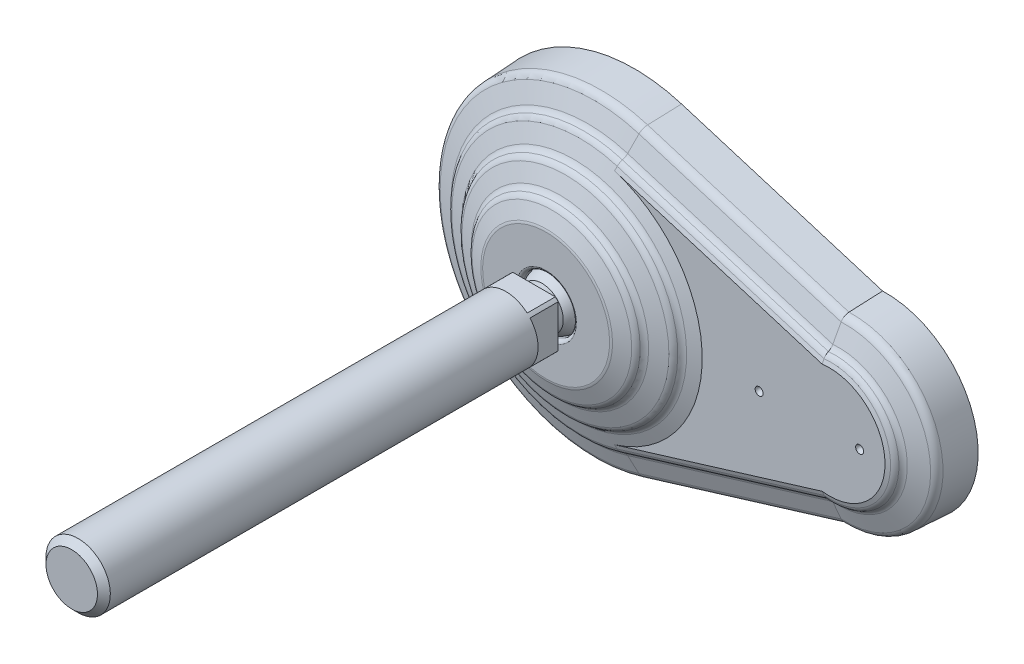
ISO-10303-21;
HEADER;
FILE_DESCRIPTION(('STEP AP214'),'2;1');
FILE_NAME('part.step','',(''),(''),'','','');
FILE_SCHEMA(('AUTOMOTIVE_DESIGN { 1 0 10303 214 1 1 1 1 }'));
ENDSEC;
DATA;
#1=APPLICATION_CONTEXT('core data for automotive mechanical design processes');
#2=APPLICATION_PROTOCOL_DEFINITION('international standard','automotive_design',2000,#1);
#3=PRODUCT_CONTEXT('',#1,'mechanical');
#4=PRODUCT('Part','Part','',(#3));
#5=PRODUCT_RELATED_PRODUCT_CATEGORY('part','',(#4));
#6=PRODUCT_DEFINITION_FORMATION('','',#4);
#7=PRODUCT_DEFINITION_CONTEXT('part definition',#1,'design');
#8=PRODUCT_DEFINITION('design','',#6,#7);
#9=PRODUCT_DEFINITION_SHAPE('','',#8);
#10=(LENGTH_UNIT() NAMED_UNIT(*) SI_UNIT(.MILLI.,.METRE.));
#11=(NAMED_UNIT(*) PLANE_ANGLE_UNIT() SI_UNIT($,.RADIAN.));
#12=(NAMED_UNIT(*) SI_UNIT($,.STERADIAN.) SOLID_ANGLE_UNIT());
#13=UNCERTAINTY_MEASURE_WITH_UNIT(LENGTH_MEASURE(1.E-05),#10,'distance_accuracy_value','');
#14=(GEOMETRIC_REPRESENTATION_CONTEXT(3) GLOBAL_UNCERTAINTY_ASSIGNED_CONTEXT((#13)) GLOBAL_UNIT_ASSIGNED_CONTEXT((#10,
#11,#12)) REPRESENTATION_CONTEXT('',''));
#15=CARTESIAN_POINT('',(0.,0.,0.));
#16=DIRECTION('',(0.,0.,1.));
#17=DIRECTION('',(1.,0.,0.));
#18=AXIS2_PLACEMENT_3D('',#15,#16,#17);
#19=CARTESIAN_POINT('',(0.,0.,32.));
#20=DIRECTION('',(0.,0.,1.));
#21=DIRECTION('',(-1.,0.,0.));
#22=AXIS2_PLACEMENT_3D('',#19,#20,#21);
#23=CYLINDRICAL_SURFACE('',#22,8.);
#24=CARTESIAN_POINT('',(0.,0.,138.4));
#25=DIRECTION('',(0.,0.,1.));
#26=DIRECTION('',(-1.,0.,0.));
#27=AXIS2_PLACEMENT_3D('',#24,#25,#26);
#28=CIRCLE('',#27,8.);
#29=CARTESIAN_POINT('',(-8.,0.,138.4));
#30=VERTEX_POINT('',#29);
#31=EDGE_CURVE('E9',#30,#30,#28,.F.);
#32=ORIENTED_EDGE('',*,*,#31,.T.);
#33=EDGE_LOOP('',(#32));
#34=FACE_BOUND('',#33,.T.);
#35=DIRECTION('',(0.,0.,1.));
#36=VECTOR('',#35,1.);
#37=CARTESIAN_POINT('',(-5.29150262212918,-6.,32.));
#38=LINE('',#37,#36);
#39=CARTESIAN_POINT('',(-5.29150262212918,-6.,32.));
#40=VERTEX_POINT('',#39);
#41=CARTESIAN_POINT('',(-5.29150262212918,-6.,25.));
#42=VERTEX_POINT('',#41);
#43=EDGE_CURVE('E399',#40,#42,#38,.F.);
#44=ORIENTED_EDGE('',*,*,#43,.F.);
#45=CARTESIAN_POINT('',(0.,0.,32.));
#46=DIRECTION('',(0.,0.,1.));
#47=DIRECTION('',(0.,-1.,0.));
#48=AXIS2_PLACEMENT_3D('',#45,#46,#47);
#49=CIRCLE('',#48,8.);
#50=CARTESIAN_POINT('',(5.29150262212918,-6.,32.));
#51=VERTEX_POINT('',#50);
#52=EDGE_CURVE('E486',#40,#51,#49,.T.);
#53=ORIENTED_EDGE('',*,*,#52,.T.);
#54=DIRECTION('',(0.,0.,1.));
#55=VECTOR('',#54,1.);
#56=CARTESIAN_POINT('',(5.29150262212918,-6.,32.));
#57=LINE('',#56,#55);
#58=CARTESIAN_POINT('',(5.29150262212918,-6.,25.));
#59=VERTEX_POINT('',#58);
#60=EDGE_CURVE('E404',#59,#51,#57,.T.);
#61=ORIENTED_EDGE('',*,*,#60,.F.);
#62=CARTESIAN_POINT('',(0.,0.,25.));
#63=DIRECTION('',(0.,0.,1.));
#64=DIRECTION('',(-1.,0.,0.));
#65=AXIS2_PLACEMENT_3D('',#62,#63,#64);
#66=CIRCLE('',#65,8.);
#67=CARTESIAN_POINT('',(6.,-5.29150262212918,25.));
#68=VERTEX_POINT('',#67);
#69=EDGE_CURVE('E522',#59,#68,#66,.T.);
#70=ORIENTED_EDGE('',*,*,#69,.T.);
#71=DIRECTION('',(0.,0.,1.));
#72=VECTOR('',#71,1.);
#73=CARTESIAN_POINT('',(6.,-5.29150262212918,32.));
#74=LINE('',#73,#72);
#75=CARTESIAN_POINT('',(6.,-5.29150262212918,32.));
#76=VERTEX_POINT('',#75);
#77=EDGE_CURVE('E407',#76,#68,#74,.F.);
#78=ORIENTED_EDGE('',*,*,#77,.F.);
#79=CARTESIAN_POINT('',(6.,5.29150262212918,32.));
#80=VERTEX_POINT('',#79);
#81=EDGE_CURVE('E401',#76,#80,#49,.T.);
#82=ORIENTED_EDGE('',*,*,#81,.T.);
#83=DIRECTION('',(0.,0.,1.));
#84=VECTOR('',#83,1.);
#85=CARTESIAN_POINT('',(6.,5.29150262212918,32.));
#86=LINE('',#85,#84);
#87=CARTESIAN_POINT('',(6.,5.29150262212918,25.));
#88=VERTEX_POINT('',#87);
#89=EDGE_CURVE('E417',#88,#80,#86,.T.);
#90=ORIENTED_EDGE('',*,*,#89,.F.);
#91=CARTESIAN_POINT('',(5.29150262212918,6.,25.));
#92=VERTEX_POINT('',#91);
#93=EDGE_CURVE('E520',#88,#92,#66,.T.);
#94=ORIENTED_EDGE('',*,*,#93,.T.);
#95=DIRECTION('',(0.,0.,1.));
#96=VECTOR('',#95,1.);
#97=CARTESIAN_POINT('',(5.29150262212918,6.,32.));
#98=LINE('',#97,#96);
#99=CARTESIAN_POINT('',(5.29150262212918,6.,32.));
#100=VERTEX_POINT('',#99);
#101=EDGE_CURVE('E420',#100,#92,#98,.F.);
#102=ORIENTED_EDGE('',*,*,#101,.F.);
#103=CARTESIAN_POINT('',(-5.29150262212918,6.,32.));
#104=VERTEX_POINT('',#103);
#105=EDGE_CURVE('E485',#100,#104,#49,.T.);
#106=ORIENTED_EDGE('',*,*,#105,.T.);
#107=DIRECTION('',(0.,0.,1.));
#108=VECTOR('',#107,1.);
#109=CARTESIAN_POINT('',(-5.29150262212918,6.,32.));
#110=LINE('',#109,#108);
#111=CARTESIAN_POINT('',(-5.29150262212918,6.,25.));
#112=VERTEX_POINT('',#111);
#113=EDGE_CURVE('E431',#112,#104,#110,.T.);
#114=ORIENTED_EDGE('',*,*,#113,.F.);
#115=CARTESIAN_POINT('',(-6.,5.29150262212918,25.));
#116=VERTEX_POINT('',#115);
#117=EDGE_CURVE('E445',#112,#116,#66,.T.);
#118=ORIENTED_EDGE('',*,*,#117,.T.);
#119=DIRECTION('',(0.,0.,1.));
#120=VECTOR('',#119,1.);
#121=CARTESIAN_POINT('',(-6.,5.29150262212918,32.));
#122=LINE('',#121,#120);
#123=CARTESIAN_POINT('',(-6.,5.29150262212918,32.));
#124=VERTEX_POINT('',#123);
#125=EDGE_CURVE('E434',#124,#116,#122,.F.);
#126=ORIENTED_EDGE('',*,*,#125,.F.);
#127=CARTESIAN_POINT('',(-6.,-5.29150262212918,32.));
#128=VERTEX_POINT('',#127);
#129=EDGE_CURVE('E480',#124,#128,#49,.T.);
#130=ORIENTED_EDGE('',*,*,#129,.T.);
#131=DIRECTION('',(0.,0.,1.));
#132=VECTOR('',#131,1.);
#133=CARTESIAN_POINT('',(-6.,-5.29150262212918,32.));
#134=LINE('',#133,#132);
#135=CARTESIAN_POINT('',(-6.,-5.29150262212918,25.));
#136=VERTEX_POINT('',#135);
#137=EDGE_CURVE('E443',#136,#128,#134,.T.);
#138=ORIENTED_EDGE('',*,*,#137,.F.);
#139=EDGE_CURVE('E388',#136,#42,#66,.T.);
#140=ORIENTED_EDGE('',*,*,#139,.T.);
#141=EDGE_LOOP('',(#44,#53,#61,#70,#78,#82,#90,#94,#102,#106,#114,#118,#126,#130,#138,#140));
#142=FACE_BOUND('',#141,.T.);
#143=ADVANCED_FACE('F14',(#34,#142),#23,.T.);
#144=CARTESIAN_POINT('',(64.1644462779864,-21.755748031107,8.30411735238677));
#145=DIRECTION('',(-0.291971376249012,0.9549953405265,-0.0523126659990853));
#146=DIRECTION('',(-0.956304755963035,-0.292371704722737,0.));
#147=AXIS2_PLACEMENT_3D('',#144,#145,#146);
#148=PLANE('',#147);
#149=CARTESIAN_POINT('',(61.6406997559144,-22.5273238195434,8.30431735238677));
#150=CARTESIAN_POINT('',(61.6501805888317,-22.600242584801,6.92023165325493));
#151=CARTESIAN_POINT('',(61.6596900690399,-22.6731526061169,5.53614569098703));
#152=CARTESIAN_POINT('',(61.6787663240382,-22.8189551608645,2.76797324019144));
#153=CARTESIAN_POINT('',(61.6883330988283,-22.8918476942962,1.38388675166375));
#154=CARTESIAN_POINT('',(61.6979285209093,-22.9647314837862,-0.000200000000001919));
#155=B_SPLINE_CURVE_WITH_KNOTS('',3,(#149,#150,#151,#152,#153,#154),.UNSPECIFIED.,.F.,.F.,(4,2,
4),(0.,4.15811282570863,8.31622565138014),.UNSPECIFIED.);
#156=CARTESIAN_POINT('',(61.6407011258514,-22.5273343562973,8.30411735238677));
#157=VERTEX_POINT('',#156);
#158=CARTESIAN_POINT('',(61.697927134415,-22.9647209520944,0.));
#159=VERTEX_POINT('',#158);
#160=EDGE_CURVE('E645',#157,#159,#155,.T.);
#161=ORIENTED_EDGE('',*,*,#160,.F.);
#162=DIRECTION('',(-0.956304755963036,-0.292371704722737,0.));
#163=VECTOR('',#162,1.);
#164=CARTESIAN_POINT('',(64.1644462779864,-21.755748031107,8.30411735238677));
#165=LINE('',#164,#163);
#166=CARTESIAN_POINT('',(11.5676847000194,-37.8361917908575,8.30411735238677));
#167=VERTEX_POINT('',#166);
#168=EDGE_CURVE('E644',#157,#167,#165,.T.);
#169=ORIENTED_EDGE('',*,*,#168,.T.);
#170=DIRECTION('',(-0.0152947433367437,0.050026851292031,0.998630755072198));
#171=VECTOR('',#170,1.);
#172=CARTESIAN_POINT('',(11.6948681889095,-38.2521902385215,0.));
#173=LINE('',#172,#171);
#174=CARTESIAN_POINT('',(11.6948681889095,-38.2521902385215,0.));
#175=VERTEX_POINT('',#174);
#176=EDGE_CURVE('E585',#175,#167,#173,.T.);
#177=ORIENTED_EDGE('',*,*,#176,.F.);
#178=DIRECTION('',(-0.956304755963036,-0.292371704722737,0.));
#179=VECTOR('',#178,1.);
#180=CARTESIAN_POINT('',(64.2916297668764,-22.1717464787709,0.));
#181=LINE('',#180,#179);
#182=EDGE_CURVE('E31',#159,#175,#181,.T.);
#183=ORIENTED_EDGE('',*,*,#182,.F.);
#184=EDGE_LOOP('',(#161,#169,#177,#183));
#185=FACE_BOUND('',#184,.T.);
#186=ADVANCED_FACE('F338',(#185),#148,.F.);
#187=CARTESIAN_POINT('',(61.6120778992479,-13.407327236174,14.));
#188=DIRECTION('',(-0.102070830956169,0.333858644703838,-0.937080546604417));
#189=DIRECTION('',(0.,0.942000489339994,0.335611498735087));
#190=AXIS2_PLACEMENT_3D('',#187,#188,#189);
#191=PLANE('',#190);
#192=CARTESIAN_POINT('',(60.6773763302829,-13.6925328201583,14.0002));
#193=CARTESIAN_POINT('',(60.6914441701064,-13.863175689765,13.9378718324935));
#194=CARTESIAN_POINT('',(60.7058313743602,-14.0337829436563,13.8755215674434));
#195=CARTESIAN_POINT('',(60.735244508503,-14.3749261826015,13.7507768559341));
#196=CARTESIAN_POINT('',(60.750270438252,-14.5454621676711,13.6883824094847));
#197=CARTESIAN_POINT('',(60.7656157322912,-14.7159625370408,13.6259658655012));
#198=B_SPLINE_CURVE_WITH_KNOTS('',3,(#192,#193,#194,#195,#196,#197),.UNSPECIFIED.,.F.,.F.,(4,2,
4),(0.,0.546637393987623,1.09327466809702),.UNSPECIFIED.);
#199=CARTESIAN_POINT('',(60.677421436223,-13.6930803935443,14.));
#200=VERTEX_POINT('',#199);
#201=CARTESIAN_POINT('',(60.765566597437,-14.7154161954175,13.6261658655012));
#202=VERTEX_POINT('',#201);
#203=EDGE_CURVE('E168',#200,#202,#198,.T.);
#204=ORIENTED_EDGE('',*,*,#203,.F.);
#205=DIRECTION('',(-0.956304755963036,-0.292371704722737,0.));
#206=VECTOR('',#205,1.);
#207=CARTESIAN_POINT('',(61.6120778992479,-13.407327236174,14.));
#208=LINE('',#207,#206);
#209=CARTESIAN_POINT('',(9.01531632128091,-29.4877709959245,14.));
#210=VERTEX_POINT('',#209);
#211=EDGE_CURVE('E172',#200,#210,#208,.T.);
#212=ORIENTED_EDGE('',*,*,#211,.T.);
#213=DIRECTION('',(-0.273975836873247,0.896134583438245,0.349113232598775));
#214=VECTOR('',#213,1.);
#215=CARTESIAN_POINT('',(9.30869253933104,-30.4473613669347,13.6261658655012));
#216=LINE('',#215,#214);
#217=CARTESIAN_POINT('',(9.30869253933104,-30.4473613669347,13.6261658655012));
#218=VERTEX_POINT('',#217);
#219=EDGE_CURVE('E171',#218,#210,#216,.T.);
#220=ORIENTED_EDGE('',*,*,#219,.F.);
#221=DIRECTION('',(-0.956304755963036,-0.292371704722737,0.));
#222=VECTOR('',#221,1.);
#223=CARTESIAN_POINT('',(61.905454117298,-14.3669176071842,13.6261658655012));
#224=LINE('',#223,#222);
#225=EDGE_CURVE('E155',#202,#218,#224,.T.);
#226=ORIENTED_EDGE('',*,*,#225,.F.);
#227=EDGE_LOOP('',(#204,#212,#220,#226));
#228=FACE_BOUND('',#227,.T.);
#229=ADVANCED_FACE('F167',(#228),#191,.F.);
#230=CARTESIAN_POINT('',(62.7507979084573,-17.131912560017,13.5370123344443));
#231=DIRECTION('',(-0.956304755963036,-0.292371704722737,0.));
#232=DIRECTION('',(0.292371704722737,-0.956304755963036,0.));
#233=AXIS2_PLACEMENT_3D('',#230,#231,#232);
#234=CYLINDRICAL_SURFACE('',#233,2.00700000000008);
#235=DIRECTION('',(-0.956304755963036,-0.292371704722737,0.));
#236=VECTOR('',#235,1.);
#237=CARTESIAN_POINT('',(62.545973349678,-16.4619616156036,11.656251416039));
#238=LINE('',#237,#236);
#239=CARTESIAN_POINT('',(60.9818619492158,-16.9401584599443,11.656251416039));
#240=VERTEX_POINT('',#239);
#241=CARTESIAN_POINT('',(9.949211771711,-32.5424053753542,11.656251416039));
#242=VERTEX_POINT('',#241);
#243=EDGE_CURVE('E650',#240,#242,#238,.T.);
#244=ORIENTED_EDGE('',*,*,#243,.F.);
#245=CARTESIAN_POINT('',(60.9819185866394,-16.9407028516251,11.656051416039));
#246=CARTESIAN_POINT('',(60.9763282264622,-16.8869710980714,11.675784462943));
#247=CARTESIAN_POINT('',(60.9708503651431,-16.8340792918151,11.697757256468));
#248=CARTESIAN_POINT('',(60.9601474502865,-16.7302929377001,11.7460604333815));
#249=CARTESIAN_POINT('',(60.9549224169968,-16.6793985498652,11.77239116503));
#250=CARTESIAN_POINT('',(60.9396574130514,-16.5300811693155,11.8578002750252));
#251=CARTESIAN_POINT('',(60.9300410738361,-16.4351542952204,11.9232476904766));
#252=CARTESIAN_POINT('',(60.9121877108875,-16.2575900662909,12.0693279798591));
#253=CARTESIAN_POINT('',(60.9039521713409,-16.1749659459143,12.1499769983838));
#254=CARTESIAN_POINT('',(60.8890756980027,-16.0247595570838,12.3241094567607));
#255=CARTESIAN_POINT('',(60.8824301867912,-15.9571341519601,12.4175548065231));
#256=CARTESIAN_POINT('',(60.8754548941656,-15.8858007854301,12.5364334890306));
#257=CARTESIAN_POINT('',(60.8742920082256,-15.8738939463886,12.5571086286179));
#258=CARTESIAN_POINT('',(60.8720425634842,-15.8508368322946,12.59885583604));
#259=CARTESIAN_POINT('',(60.8709559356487,-15.839685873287,12.6199275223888));
#260=CARTESIAN_POINT('',(60.869906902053,-15.8289098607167,12.6412000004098));
#261=B_SPLINE_CURVE_WITH_KNOTS('',3,(#245,#246,#247,#248,#249,#250,#251,#252,#253,#254,#255,
#256,#257,#258,#259,#260),.UNSPECIFIED.,.F.,.F.,(4,2,2,2,2,2,2,4),(0.,0.172434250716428,
0.34488228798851,0.690191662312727,1.0358698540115,1.38054058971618,1.4521941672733,
1.52378201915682),.UNSPECIFIED.);
#262=CARTESIAN_POINT('',(60.8699167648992,-15.8290111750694,12.6410000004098));
#263=VERTEX_POINT('',#262);
#264=EDGE_CURVE('E266',#240,#263,#261,.T.);
#265=ORIENTED_EDGE('',*,*,#264,.T.);
#266=DIRECTION('',(-0.956304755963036,-0.292371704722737,0.));
#267=VECTOR('',#266,1.);
#268=CARTESIAN_POINT('',(62.2257313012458,-15.4144970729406,12.6410000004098));
#269=LINE('',#268,#267);
#270=CARTESIAN_POINT('',(9.62896972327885,-31.4949408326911,12.6410000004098));
#271=VERTEX_POINT('',#270);
#272=EDGE_CURVE('E157',#263,#271,#269,.T.);
#273=ORIENTED_EDGE('',*,*,#272,.T.);
#274=CARTESIAN_POINT('',(10.1540363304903,-33.2123563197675,13.5370123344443));
#275=DIRECTION('',(0.956304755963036,0.292371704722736,0.));
#276=DIRECTION('',(-0.292371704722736,0.956304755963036,0.));
#277=AXIS2_PLACEMENT_3D('',#274,#275,#276);
#278=CIRCLE('',#277,2.00700000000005);
#279=EDGE_CURVE('E597',#242,#271,#278,.T.);
#280=ORIENTED_EDGE('',*,*,#279,.F.);
#281=EDGE_LOOP('',(#244,#265,#273,#280));
#282=FACE_BOUND('',#281,.T.);
#283=ADVANCED_FACE('F317',(#282),#234,.F.);
#284=CARTESIAN_POINT('',(62.545973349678,-16.4619616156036,11.656251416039));
#285=DIRECTION('',(-0.102055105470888,0.333807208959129,-0.937100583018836));
#286=DIRECTION('',(0.,0.942019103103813,0.335559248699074));
#287=AXIS2_PLACEMENT_3D('',#284,#285,#286);
#288=PLANE('',#287);
#289=CARTESIAN_POINT('',(60.9818053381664,-16.9396143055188,11.656451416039));
#290=CARTESIAN_POINT('',(61.0189355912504,-17.2964789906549,11.5252879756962));
#291=CARTESIAN_POINT('',(61.0571375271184,-17.653206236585,11.3940567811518));
#292=CARTESIAN_POINT('',(61.1355151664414,-18.3663907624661,11.1314756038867));
#293=CARTESIAN_POINT('',(61.1756908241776,-18.7228480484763,11.0001256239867));
#294=CARTESIAN_POINT('',(61.2578477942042,-19.435511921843,10.7373183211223));
#295=CARTESIAN_POINT('',(61.2998290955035,-19.7917185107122,10.6058609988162));
#296=CARTESIAN_POINT('',(61.3854616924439,-20.5039033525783,10.3428458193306));
#297=CARTESIAN_POINT('',(61.4291130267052,-20.8598816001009,10.2112879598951));
#298=CARTESIAN_POINT('',(61.4735304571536,-21.2157475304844,10.0796866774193));
#299=B_SPLINE_CURVE_WITH_KNOTS('',3,(#289,#290,#291,#292,#293,#294,#295,#296,#297,#298),
.UNSPECIFIED.,.F.,.F.,(4,2,2,2,4),(0.,1.14603990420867,2.29205327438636,3.43805966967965,
4.58409258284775),.UNSPECIFIED.);
#300=CARTESIAN_POINT('',(61.4734629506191,-21.2152067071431,10.0798866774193));
#301=VERTEX_POINT('',#300);
#302=EDGE_CURVE('E298',#240,#301,#299,.T.);
#303=ORIENTED_EDGE('',*,*,#302,.F.);
#304=ORIENTED_EDGE('',*,*,#243,.T.);
#305=DIRECTION('',(-0.273981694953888,0.896153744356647,0.349059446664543));
#306=VECTOR('',#305,1.);
#307=CARTESIAN_POINT('',(11.1865227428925,-36.5894672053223,10.0798866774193));
#308=LINE('',#307,#306);
#309=CARTESIAN_POINT('',(11.1865227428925,-36.5894672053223,10.0798866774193));
#310=VERTEX_POINT('',#309);
#311=EDGE_CURVE('E594',#310,#242,#308,.T.);
#312=ORIENTED_EDGE('',*,*,#311,.F.);
#313=DIRECTION('',(-0.956304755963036,-0.292371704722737,0.));
#314=VECTOR('',#313,1.);
#315=CARTESIAN_POINT('',(63.7832843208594,-20.5090234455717,10.0798866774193));
#316=LINE('',#315,#314);
#317=EDGE_CURVE('E647',#301,#310,#316,.T.);
#318=ORIENTED_EDGE('',*,*,#317,.F.);
#319=EDGE_LOOP('',(#303,#304,#312,#318));
#320=FACE_BOUND('',#319,.T.);
#321=ADVANCED_FACE('F312',(#320),#288,.F.);
#322=CARTESIAN_POINT('',(64.2916297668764,22.1717464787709,0.));
#323=DIRECTION('',(-0.291971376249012,-0.9549953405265,-0.0523126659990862));
#324=DIRECTION('',(0.956304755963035,-0.292371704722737,0.));
#325=AXIS2_PLACEMENT_3D('',#322,#323,#324);
#326=PLANE('',#325);
#327=CARTESIAN_POINT('',(61.6979285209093,22.9647314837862,-0.000199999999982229));
#328=CARTESIAN_POINT('',(61.6883330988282,22.8918476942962,1.38388675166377));
#329=CARTESIAN_POINT('',(61.6787663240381,22.8189551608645,2.76797324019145));
#330=CARTESIAN_POINT('',(61.6596900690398,22.6731526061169,5.53614569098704));
#331=CARTESIAN_POINT('',(61.6501805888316,22.600242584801,6.92023165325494));
#332=CARTESIAN_POINT('',(61.6406997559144,22.5273238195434,8.30431735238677));
#333=B_SPLINE_CURVE_WITH_KNOTS('',3,(#327,#328,#329,#330,#331,#332),.UNSPECIFIED.,.F.,.F.,(4,2,
4),(0.,4.1581128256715,8.31622565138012),.UNSPECIFIED.);
#334=CARTESIAN_POINT('',(61.6979271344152,22.9647209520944,0.));
#335=VERTEX_POINT('',#334);
#336=CARTESIAN_POINT('',(61.6407011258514,22.5273343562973,8.30411735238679));
#337=VERTEX_POINT('',#336);
#338=EDGE_CURVE('E694',#335,#337,#333,.T.);
#339=ORIENTED_EDGE('',*,*,#338,.F.);
#340=DIRECTION('',(-0.956304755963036,0.292371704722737,0.));
#341=VECTOR('',#340,1.);
#342=CARTESIAN_POINT('',(64.2916297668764,22.1717464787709,0.));
#343=LINE('',#342,#341);
#344=CARTESIAN_POINT('',(11.6948681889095,38.2521902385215,0.));
#345=VERTEX_POINT('',#344);
#346=EDGE_CURVE('E648',#335,#345,#343,.T.);
#347=ORIENTED_EDGE('',*,*,#346,.T.);
#348=DIRECTION('',(-0.0152947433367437,-0.050026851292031,0.998630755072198));
#349=VECTOR('',#348,1.);
#350=CARTESIAN_POINT('',(11.6948681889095,38.2521902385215,0.));
#351=LINE('',#350,#349);
#352=CARTESIAN_POINT('',(11.5676847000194,37.8361917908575,8.30411735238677));
#353=VERTEX_POINT('',#352);
#354=EDGE_CURVE('E603',#345,#353,#351,.T.);
#355=ORIENTED_EDGE('',*,*,#354,.T.);
#356=DIRECTION('',(-0.956304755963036,0.292371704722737,0.));
#357=VECTOR('',#356,1.);
#358=CARTESIAN_POINT('',(64.1644462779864,21.755748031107,8.30411735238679));
#359=LINE('',#358,#357);
#360=EDGE_CURVE('E652',#337,#353,#359,.T.);
#361=ORIENTED_EDGE('',*,*,#360,.F.);
#362=EDGE_LOOP('',(#339,#347,#355,#361));
#363=FACE_BOUND('',#362,.T.);
#364=ADVANCED_FACE('F316',(#363),#326,.F.);
#365=CARTESIAN_POINT('',(63.7832843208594,20.5090234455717,10.0798866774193));
#366=DIRECTION('',(-0.102055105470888,-0.333807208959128,-0.937100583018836));
#367=DIRECTION('',(0.,0.942019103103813,-0.335559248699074));
#368=AXIS2_PLACEMENT_3D('',#365,#366,#367);
#369=PLANE('',#368);
#370=CARTESIAN_POINT('',(61.4735304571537,21.2157475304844,10.0796866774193));
#371=CARTESIAN_POINT('',(61.4291130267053,20.8598816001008,10.2112879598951));
#372=CARTESIAN_POINT('',(61.3854616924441,20.5039033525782,10.3428458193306));
#373=CARTESIAN_POINT('',(61.2998290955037,19.7917185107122,10.6058609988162));
#374=CARTESIAN_POINT('',(61.2578477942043,19.435511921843,10.7373183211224));
#375=CARTESIAN_POINT('',(61.1756908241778,18.7228480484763,11.0001256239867));
#376=CARTESIAN_POINT('',(61.1355151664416,18.3663907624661,11.1314756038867));
#377=CARTESIAN_POINT('',(61.0571375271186,17.653206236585,11.3940567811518));
#378=CARTESIAN_POINT('',(61.0189355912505,17.2964789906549,11.5252879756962));
#379=CARTESIAN_POINT('',(60.9818053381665,16.9396143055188,11.656451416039));
#380=B_SPLINE_CURVE_WITH_KNOTS('',3,(#370,#371,#372,#373,#374,#375,#376,#377,#378,#379),
.UNSPECIFIED.,.F.,.F.,(4,2,2,2,4),(0.,1.1460329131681,2.29203930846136,3.43805267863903,
4.58409258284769),.UNSPECIFIED.);
#381=CARTESIAN_POINT('',(61.4734629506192,21.2152067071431,10.0798866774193));
#382=VERTEX_POINT('',#381);
#383=CARTESIAN_POINT('',(60.9818619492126,16.9401584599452,11.656251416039));
#384=VERTEX_POINT('',#383);
#385=EDGE_CURVE('E292',#382,#384,#380,.T.);
#386=ORIENTED_EDGE('',*,*,#385,.F.);
#387=DIRECTION('',(-0.956304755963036,0.292371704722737,0.));
#388=VECTOR('',#387,1.);
#389=CARTESIAN_POINT('',(63.7832843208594,20.5090234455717,10.0798866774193));
#390=LINE('',#389,#388);
#391=CARTESIAN_POINT('',(11.1865227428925,36.5894672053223,10.0798866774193));
#392=VERTEX_POINT('',#391);
#393=EDGE_CURVE('E683',#382,#392,#390,.T.);
#394=ORIENTED_EDGE('',*,*,#393,.T.);
#395=DIRECTION('',(-0.273981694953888,-0.896153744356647,0.349059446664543));
#396=VECTOR('',#395,1.);
#397=CARTESIAN_POINT('',(11.1865227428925,36.5894672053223,10.0798866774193));
#398=LINE('',#397,#396);
#399=CARTESIAN_POINT('',(9.949211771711,32.5424053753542,11.656251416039));
#400=VERTEX_POINT('',#399);
#401=EDGE_CURVE('E609',#392,#400,#398,.T.);
#402=ORIENTED_EDGE('',*,*,#401,.T.);
#403=DIRECTION('',(-0.956304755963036,0.292371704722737,0.));
#404=VECTOR('',#403,1.);
#405=CARTESIAN_POINT('',(62.545973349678,16.4619616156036,11.656251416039));
#406=LINE('',#405,#404);
#407=EDGE_CURVE('E684',#384,#400,#406,.T.);
#408=ORIENTED_EDGE('',*,*,#407,.F.);
#409=EDGE_LOOP('',(#386,#394,#402,#408));
#410=FACE_BOUND('',#409,.T.);
#411=ADVANCED_FACE('F255',(#410),#369,.F.);
#412=CARTESIAN_POINT('',(62.7507979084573,17.1319125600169,13.5370123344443));
#413=DIRECTION('',(-0.956304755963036,0.292371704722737,0.));
#414=DIRECTION('',(-0.292371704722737,-0.956304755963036,0.));
#415=AXIS2_PLACEMENT_3D('',#412,#413,#414);
#416=CYLINDRICAL_SURFACE('',#415,2.007);
#417=DIRECTION('',(-0.956304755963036,0.292371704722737,0.));
#418=VECTOR('',#417,1.);
#419=CARTESIAN_POINT('',(62.2257313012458,15.4144970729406,12.6410000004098));
#420=LINE('',#419,#418);
#421=CARTESIAN_POINT('',(60.8699167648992,15.8290111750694,12.6410000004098));
#422=VERTEX_POINT('',#421);
#423=CARTESIAN_POINT('',(9.62896972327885,31.4949408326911,12.6410000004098));
#424=VERTEX_POINT('',#423);
#425=EDGE_CURVE('E773',#422,#424,#420,.T.);
#426=ORIENTED_EDGE('',*,*,#425,.F.);
#427=CARTESIAN_POINT('',(60.869906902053,15.8289098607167,12.6412000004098));
#428=CARTESIAN_POINT('',(60.8724049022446,15.8545692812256,12.5905409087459));
#429=CARTESIAN_POINT('',(60.8751177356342,15.882373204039,12.5410120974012));
#430=CARTESIAN_POINT('',(60.8809599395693,15.9420653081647,12.4445128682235));
#431=CARTESIAN_POINT('',(60.8840892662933,15.9739530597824,12.3975421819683));
#432=CARTESIAN_POINT('',(60.8940798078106,16.0754098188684,12.2609440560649));
#433=CARTESIAN_POINT('',(60.9015461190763,16.1507985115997,12.1755790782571));
#434=CARTESIAN_POINT('',(60.9179069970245,16.3146445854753,12.0187596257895));
#435=CARTESIAN_POINT('',(60.9268017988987,16.4031041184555,11.9473074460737));
#436=CARTESIAN_POINT('',(60.9458071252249,16.5904449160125,11.8202080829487));
#437=CARTESIAN_POINT('',(60.9559150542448,16.6893038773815,11.7645279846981));
#438=CARTESIAN_POINT('',(60.9690169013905,16.8162843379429,11.7062217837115));
#439=CARTESIAN_POINT('',(60.9715630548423,16.8409104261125,11.6954970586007));
#440=CARTESIAN_POINT('',(60.9767040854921,16.8905299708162,11.6750365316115));
#441=CARTESIAN_POINT('',(60.9792989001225,16.9155229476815,11.6652995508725));
#442=CARTESIAN_POINT('',(60.9819185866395,16.940702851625,11.656051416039));
#443=B_SPLINE_CURVE_WITH_KNOTS('',3,(#427,#428,#429,#430,#431,#432,#433,#434,#435,#436,#437,
#438,#439,#440,#441,#442),.UNSPECIFIED.,.F.,.F.,(4,2,2,2,2,2,2,4),(0.,0.170415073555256,
0.340812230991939,0.681435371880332,1.0221146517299,1.36207763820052,1.44300799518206,
1.52384059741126),.UNSPECIFIED.);
#444=EDGE_CURVE('E161',#422,#384,#443,.T.);
#445=ORIENTED_EDGE('',*,*,#444,.T.);
#446=ORIENTED_EDGE('',*,*,#407,.T.);
#447=CARTESIAN_POINT('',(10.1540363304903,33.2123563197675,13.5370123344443));
#448=DIRECTION('',(-0.956304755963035,0.292371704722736,0.));
#449=DIRECTION('',(-0.292371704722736,-0.956304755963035,0.));
#450=AXIS2_PLACEMENT_3D('',#447,#448,#449);
#451=CIRCLE('',#450,2.00700000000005);
#452=EDGE_CURVE('E612',#400,#424,#451,.T.);
#453=ORIENTED_EDGE('',*,*,#452,.T.);
#454=EDGE_LOOP('',(#426,#445,#446,#453));
#455=FACE_BOUND('',#454,.T.);
#456=ADVANCED_FACE('F242',(#455),#416,.F.);
#457=CARTESIAN_POINT('',(61.905454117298,14.3669176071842,13.6261658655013));
#458=DIRECTION('',(-0.102070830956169,-0.333858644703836,-0.937080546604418));
#459=DIRECTION('',(0.,0.942000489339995,-0.335611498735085));
#460=AXIS2_PLACEMENT_3D('',#457,#458,#459);
#461=PLANE('',#460);
#462=CARTESIAN_POINT('',(60.7656157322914,14.7159625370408,13.6259658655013));
#463=CARTESIAN_POINT('',(60.7502704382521,14.5454621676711,13.6883824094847));
#464=CARTESIAN_POINT('',(60.735244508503,14.3749261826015,13.7507768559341));
#465=CARTESIAN_POINT('',(60.7058313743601,14.0337829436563,13.8755215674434));
#466=CARTESIAN_POINT('',(60.6914441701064,13.863175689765,13.9378718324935));
#467=CARTESIAN_POINT('',(60.6773763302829,13.6925328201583,14.0002));
#468=B_SPLINE_CURVE_WITH_KNOTS('',3,(#462,#463,#464,#465,#466,#467),.UNSPECIFIED.,.F.,.F.,(4,2,
4),(0.,0.546637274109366,1.09327466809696),.UNSPECIFIED.);
#469=CARTESIAN_POINT('',(60.7655665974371,14.7154161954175,13.6261658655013));
#470=VERTEX_POINT('',#469);
#471=CARTESIAN_POINT('',(60.6774214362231,13.6930803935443,14.));
#472=VERTEX_POINT('',#471);
#473=EDGE_CURVE('E225',#470,#472,#468,.T.);
#474=ORIENTED_EDGE('',*,*,#473,.F.);
#475=DIRECTION('',(-0.956304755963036,0.292371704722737,0.));
#476=VECTOR('',#475,1.);
#477=CARTESIAN_POINT('',(61.905454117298,14.3669176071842,13.6261658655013));
#478=LINE('',#477,#476);
#479=CARTESIAN_POINT('',(9.30869253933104,30.4473613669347,13.6261658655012));
#480=VERTEX_POINT('',#479);
#481=EDGE_CURVE('E771',#470,#480,#478,.T.);
#482=ORIENTED_EDGE('',*,*,#481,.T.);
#483=DIRECTION('',(-0.273975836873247,-0.896134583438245,0.349113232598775));
#484=VECTOR('',#483,1.);
#485=CARTESIAN_POINT('',(9.30869253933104,30.4473613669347,13.6261658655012));
#486=LINE('',#485,#484);
#487=CARTESIAN_POINT('',(9.01531632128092,29.4877709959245,14.));
#488=VERTEX_POINT('',#487);
#489=EDGE_CURVE('E618',#480,#488,#486,.T.);
#490=ORIENTED_EDGE('',*,*,#489,.T.);
#491=DIRECTION('',(-0.956304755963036,0.292371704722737,0.));
#492=VECTOR('',#491,1.);
#493=CARTESIAN_POINT('',(61.6120778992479,13.4073272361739,14.));
#494=LINE('',#493,#492);
#495=EDGE_CURVE('E75',#472,#488,#494,.T.);
#496=ORIENTED_EDGE('',*,*,#495,.F.);
#497=EDGE_LOOP('',(#474,#482,#490,#496));
#498=FACE_BOUND('',#497,.T.);
#499=ADVANCED_FACE('F237',(#498),#461,.F.);
#500=CARTESIAN_POINT('',(0.,0.,0.));
#501=DIRECTION('',(0.,0.,1.));
#502=DIRECTION('',(-1.,0.,0.));
#503=AXIS2_PLACEMENT_3D('',#500,#501,#502);
#504=PLANE('',#503);
#505=ORIENTED_EDGE('',*,*,#346,.F.);
#506=CARTESIAN_POINT('',(62.5,0.,0.));
#507=DIRECTION('',(0.,0.,1.));
#508=DIRECTION('',(0.,-1.,0.));
#509=AXIS2_PLACEMENT_3D('',#506,#507,#508);
#510=CIRCLE('',#509,22.9787234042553);
#511=EDGE_CURVE('E181',#159,#335,#510,.T.);
#512=ORIENTED_EDGE('',*,*,#511,.F.);
#513=ORIENTED_EDGE('',*,*,#182,.T.);
#514=CARTESIAN_POINT('',(0.,0.,0.));
#515=DIRECTION('',(0.,0.,1.));
#516=DIRECTION('',(-1.,0.,0.));
#517=AXIS2_PLACEMENT_3D('',#514,#515,#516);
#518=CIRCLE('',#517,40.);
#519=EDGE_CURVE('E233',#345,#175,#518,.T.);
#520=ORIENTED_EDGE('',*,*,#519,.F.);
#521=EDGE_LOOP('',(#505,#512,#513,#520));
#522=FACE_BOUND('',#521,.T.);
#523=CARTESIAN_POINT('',(70.,0.,0.));
#524=DIRECTION('',(0.,0.,-1.));
#525=DIRECTION('',(-1.,0.,0.));
#526=AXIS2_PLACEMENT_3D('',#523,#524,#525);
#527=CIRCLE('',#526,5.25);
#528=CARTESIAN_POINT('',(64.75,0.,0.));
#529=VERTEX_POINT('',#528);
#530=EDGE_CURVE('E491',#529,#529,#527,.T.);
#531=ORIENTED_EDGE('',*,*,#530,.F.);
#532=EDGE_LOOP('',(#531));
#533=FACE_BOUND('',#532,.T.);
#534=CARTESIAN_POINT('',(45.,0.,0.));
#535=DIRECTION('',(0.,0.,-1.));
#536=DIRECTION('',(-1.,0.,0.));
#537=AXIS2_PLACEMENT_3D('',#534,#535,#536);
#538=CIRCLE('',#537,5.25);
#539=CARTESIAN_POINT('',(39.75,0.,0.));
#540=VERTEX_POINT('',#539);
#541=EDGE_CURVE('E1165',#540,#540,#538,.T.);
#542=ORIENTED_EDGE('',*,*,#541,.F.);
#543=EDGE_LOOP('',(#542));
#544=FACE_BOUND('',#543,.T.);
#545=ADVANCED_FACE('F241',(#522,#533,#544),#504,.F.);
#546=CARTESIAN_POINT('',(0.,0.,0.));
#547=DIRECTION('',(0.,0.,-1.));
#548=DIRECTION('',(1.,0.,0.));
#549=AXIS2_PLACEMENT_3D('',#546,#547,#548);
#550=CONICAL_SURFACE('',#549,40.,0.0523365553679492);
#551=CARTESIAN_POINT('',(0.,0.,8.30411735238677));
#552=DIRECTION('',(0.,0.,1.));
#553=DIRECTION('',(-1.,0.,0.));
#554=AXIS2_PLACEMENT_3D('',#551,#552,#553);
#555=CIRCLE('',#554,39.5649938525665);
#556=EDGE_CURVE('E631',#353,#167,#555,.T.);
#557=ORIENTED_EDGE('',*,*,#556,.F.);
#558=ORIENTED_EDGE('',*,*,#354,.F.);
#559=ORIENTED_EDGE('',*,*,#519,.T.);
#560=ORIENTED_EDGE('',*,*,#176,.T.);
#561=EDGE_LOOP('',(#557,#558,#559,#560));
#562=FACE_BOUND('',#561,.T.);
#563=ADVANCED_FACE('F640',(#562),#550,.T.);
#564=CARTESIAN_POINT('',(0.,0.,8.19912580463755));
#565=DIRECTION('',(0.,0.,1.));
#566=DIRECTION('',(-1.,0.,0.));
#567=AXIS2_PLACEMENT_3D('',#564,#565,#566);
#568=TOROIDAL_SURFACE('',#567,37.5607419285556,2.007);
#569=CARTESIAN_POINT('',(0.,0.,10.0798866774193));
#570=DIRECTION('',(0.,0.,1.));
#571=DIRECTION('',(-1.,0.,0.));
#572=AXIS2_PLACEMENT_3D('',#569,#570,#571);
#573=CIRCLE('',#572,38.2613042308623);
#574=EDGE_CURVE('E629',#392,#310,#573,.T.);
#575=ORIENTED_EDGE('',*,*,#574,.F.);
#576=CARTESIAN_POINT('',(10.9816981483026,35.9195161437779,8.19912580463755));
#577=DIRECTION('',(-0.956304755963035,0.292371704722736,0.));
#578=DIRECTION('',(-0.292371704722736,-0.956304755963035,0.));
#579=AXIS2_PLACEMENT_3D('',#576,#577,#578);
#580=CIRCLE('',#579,2.007);
#581=EDGE_CURVE('E606',#392,#353,#580,.T.);
#582=ORIENTED_EDGE('',*,*,#581,.T.);
#583=ORIENTED_EDGE('',*,*,#556,.T.);
#584=CARTESIAN_POINT('',(10.9816981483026,-35.9195161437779,8.19912580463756));
#585=DIRECTION('',(0.956304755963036,0.292371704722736,0.));
#586=DIRECTION('',(-0.292371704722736,0.956304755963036,0.));
#587=AXIS2_PLACEMENT_3D('',#584,#585,#586);
#588=CIRCLE('',#587,2.007);
#589=EDGE_CURVE('E591',#310,#167,#588,.T.);
#590=ORIENTED_EDGE('',*,*,#589,.F.);
#591=EDGE_LOOP('',(#575,#582,#583,#590));
#592=FACE_BOUND('',#591,.T.);
#593=ADVANCED_FACE('F777',(#592),#568,.T.);
#594=CARTESIAN_POINT('',(0.,0.,10.0798866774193));
#595=DIRECTION('',(0.,0.,-1.));
#596=DIRECTION('',(1.,0.,0.));
#597=AXIS2_PLACEMENT_3D('',#594,#595,#596);
#598=CONICAL_SURFACE('',#597,38.2613042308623,1.21422909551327);
#599=CARTESIAN_POINT('',(0.,0.,11.656251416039));
#600=DIRECTION('',(0.,0.,1.));
#601=DIRECTION('',(-1.,0.,0.));
#602=AXIS2_PLACEMENT_3D('',#599,#600,#601);
#603=CIRCLE('',#602,34.0293250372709);
#604=EDGE_CURVE('E626',#400,#242,#603,.T.);
#605=ORIENTED_EDGE('',*,*,#604,.F.);
#606=ORIENTED_EDGE('',*,*,#401,.F.);
#607=ORIENTED_EDGE('',*,*,#574,.T.);
#608=ORIENTED_EDGE('',*,*,#311,.T.);
#609=EDGE_LOOP('',(#605,#606,#607,#608));
#610=FACE_BOUND('',#609,.T.);
#611=ADVANCED_FACE('F672',(#610),#598,.T.);
#612=CARTESIAN_POINT('',(0.,0.,13.5370123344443));
#613=DIRECTION('',(0.,0.,1.));
#614=DIRECTION('',(-1.,0.,0.));
#615=AXIS2_PLACEMENT_3D('',#612,#613,#614);
#616=TOROIDAL_SURFACE('',#615,34.7298872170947,2.00700000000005);
#617=CARTESIAN_POINT('',(0.,0.,12.6410000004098));
#618=DIRECTION('',(0.,0.,1.));
#619=DIRECTION('',(-1.,0.,0.));
#620=AXIS2_PLACEMENT_3D('',#617,#618,#619);
#621=CIRCLE('',#620,32.9339999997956);
#622=EDGE_CURVE('E623',#424,#271,#621,.T.);
#623=ORIENTED_EDGE('',*,*,#622,.F.);
#624=ORIENTED_EDGE('',*,*,#452,.F.);
#625=ORIENTED_EDGE('',*,*,#604,.T.);
#626=ORIENTED_EDGE('',*,*,#279,.T.);
#627=EDGE_LOOP('',(#623,#624,#625,#626));
#628=FACE_BOUND('',#627,.T.);
#629=ADVANCED_FACE('F667',(#628),#616,.F.);
#630=CARTESIAN_POINT('',(0.,0.,11.7454451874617));
#631=DIRECTION('',(0.,0.,1.));
#632=DIRECTION('',(-1.,0.,0.));
#633=AXIS2_PLACEMENT_3D('',#630,#631,#632);
#634=TOROIDAL_SURFACE('',#633,31.1378845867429,2.007);
#635=CARTESIAN_POINT('',(0.,0.,13.6261658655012));
#636=DIRECTION('',(0.,0.,1.));
#637=DIRECTION('',(-1.,0.,0.));
#638=AXIS2_PLACEMENT_3D('',#635,#636,#637);
#639=CIRCLE('',#638,31.8385547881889);
#640=EDGE_CURVE('E621',#480,#218,#639,.T.);
#641=ORIENTED_EDGE('',*,*,#640,.F.);
#642=CARTESIAN_POINT('',(9.10383639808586,29.7773071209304,11.7454451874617));
#643=DIRECTION('',(-0.956304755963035,0.292371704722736,0.));
#644=DIRECTION('',(-0.292371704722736,-0.956304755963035,0.));
#645=AXIS2_PLACEMENT_3D('',#642,#643,#644);
#646=CIRCLE('',#645,2.007);
#647=EDGE_CURVE('E615',#480,#424,#646,.T.);
#648=ORIENTED_EDGE('',*,*,#647,.T.);
#649=ORIENTED_EDGE('',*,*,#622,.T.);
#650=CARTESIAN_POINT('',(9.10383639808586,-29.7773071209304,11.7454451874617));
#651=DIRECTION('',(0.956304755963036,0.292371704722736,0.));
#652=DIRECTION('',(-0.292371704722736,0.956304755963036,0.));
#653=AXIS2_PLACEMENT_3D('',#650,#651,#652);
#654=CIRCLE('',#653,2.007);
#655=EDGE_CURVE('E600',#218,#271,#654,.T.);
#656=ORIENTED_EDGE('',*,*,#655,.F.);
#657=EDGE_LOOP('',(#641,#648,#649,#656));
#658=FACE_BOUND('',#657,.T.);
#659=ADVANCED_FACE('F663',(#658),#634,.T.);
#660=CARTESIAN_POINT('',(0.,0.,13.6261658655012));
#661=DIRECTION('',(0.,0.,-1.));
#662=DIRECTION('',(1.,0.,0.));
#663=AXIS2_PLACEMENT_3D('',#660,#661,#662);
#664=CONICAL_SURFACE('',#663,31.8385547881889,1.21417169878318);
#665=CARTESIAN_POINT('',(0.,0.,15.054));
#666=DIRECTION('',(0.,0.,1.));
#667=DIRECTION('',(0.,-1.,0.));
#668=AXIS2_PLACEMENT_3D('',#665,#666,#667);
#669=CIRCLE('',#668,28.006);
#670=CARTESIAN_POINT('',(0.,-28.006,15.054));
#671=VERTEX_POINT('',#670);
#672=EDGE_CURVE('E780',#671,#671,#669,.T.);
#673=ORIENTED_EDGE('',*,*,#672,.F.);
#674=EDGE_LOOP('',(#673));
#675=FACE_BOUND('',#674,.T.);
#676=CARTESIAN_POINT('',(0.,0.,14.));
#677=DIRECTION('',(0.,0.,1.));
#678=DIRECTION('',(0.,-1.,0.));
#679=AXIS2_PLACEMENT_3D('',#676,#677,#678);
#680=CIRCLE('',#679,30.8351190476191);
#681=EDGE_CURVE('E583',#210,#488,#680,.T.);
#682=ORIENTED_EDGE('',*,*,#681,.T.);
#683=ORIENTED_EDGE('',*,*,#489,.F.);
#684=ORIENTED_EDGE('',*,*,#640,.T.);
#685=ORIENTED_EDGE('',*,*,#219,.T.);
#686=EDGE_LOOP('',(#682,#683,#684,#685));
#687=FACE_BOUND('',#686,.T.);
#688=ADVANCED_FACE('F334',(#675,#687),#664,.T.);
#689=CARTESIAN_POINT('',(9.01531632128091,29.4877709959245,14.));
#690=DIRECTION('',(0.,0.,-1.));
#691=DIRECTION('',(1.,0.,0.));
#692=AXIS2_PLACEMENT_3D('',#689,#690,#691);
#693=PLANE('',#692);
#694=CARTESIAN_POINT('',(45.,0.,14.));
#695=DIRECTION('',(0.,0.,-1.));
#696=DIRECTION('',(0.,1.,0.));
#697=AXIS2_PLACEMENT_3D('',#694,#695,#696);
#698=CIRCLE('',#697,1.);
#699=CARTESIAN_POINT('',(45.,1.,14.));
#700=VERTEX_POINT('',#699);
#701=EDGE_CURVE('E439',#700,#700,#698,.T.);
#702=ORIENTED_EDGE('',*,*,#701,.T.);
#703=EDGE_LOOP('',(#702));
#704=FACE_BOUND('',#703,.T.);
#705=CARTESIAN_POINT('',(70.,0.,14.));
#706=DIRECTION('',(0.,0.,-1.));
#707=DIRECTION('',(0.,1.,0.));
#708=AXIS2_PLACEMENT_3D('',#705,#706,#707);
#709=CIRCLE('',#708,1.);
#710=CARTESIAN_POINT('',(70.,1.,14.));
#711=VERTEX_POINT('',#710);
#712=EDGE_CURVE('E576',#711,#711,#709,.T.);
#713=ORIENTED_EDGE('',*,*,#712,.T.);
#714=EDGE_LOOP('',(#713));
#715=FACE_BOUND('',#714,.T.);
#716=ORIENTED_EDGE('',*,*,#211,.F.);
#717=CARTESIAN_POINT('',(62.5,0.,14.));
#718=DIRECTION('',(0.,0.,1.));
#719=DIRECTION('',(0.,-1.,0.));
#720=AXIS2_PLACEMENT_3D('',#717,#718,#719);
#721=CIRCLE('',#720,13.8138424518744);
#722=EDGE_CURVE('E180',#200,#472,#721,.T.);
#723=ORIENTED_EDGE('',*,*,#722,.T.);
#724=ORIENTED_EDGE('',*,*,#495,.T.);
#725=ORIENTED_EDGE('',*,*,#681,.F.);
#726=EDGE_LOOP('',(#716,#723,#724,#725));
#727=FACE_BOUND('',#726,.T.);
#728=ADVANCED_FACE('F327',(#704,#715,#727),#693,.F.);
#729=CARTESIAN_POINT('',(61.7005979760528,-13.6968633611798,11.7454451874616));
#730=DIRECTION('',(-0.956304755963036,-0.292371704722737,0.));
#731=DIRECTION('',(0.292371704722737,-0.956304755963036,0.));
#732=AXIS2_PLACEMENT_3D('',#729,#730,#731);
#733=CYLINDRICAL_SURFACE('',#732,2.007);
#734=ORIENTED_EDGE('',*,*,#272,.F.);
#735=CARTESIAN_POINT('',(60.8699266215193,-15.8291124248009,12.6408000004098));
#736=CARTESIAN_POINT('',(60.8674327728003,-15.8034938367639,12.6914108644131));
#737=CARTESIAN_POINT('',(60.8647362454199,-15.7757317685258,12.74089344));
#738=CARTESIAN_POINT('',(60.858964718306,-15.7161228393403,12.8373036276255));
#739=CARTESIAN_POINT('',(60.8558897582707,-15.6842764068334,12.8842315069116));
#740=CARTESIAN_POINT('',(60.8461407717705,-15.5829473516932,13.0206941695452));
#741=CARTESIAN_POINT('',(60.8389394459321,-15.5076423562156,13.1059721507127));
#742=CARTESIAN_POINT('',(60.8234284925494,-15.3439431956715,13.2626343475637));
#743=CARTESIAN_POINT('',(60.8151186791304,-15.2555468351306,13.3340162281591));
#744=CARTESIAN_POINT('',(60.7977056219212,-15.0683060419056,13.4610128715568));
#745=CARTESIAN_POINT('',(60.7886040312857,-14.9694832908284,13.5166595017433));
#746=CARTESIAN_POINT('',(60.7770047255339,-14.8420034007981,13.5752115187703));
#747=CARTESIAN_POINT('',(60.7747221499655,-14.8168458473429,13.586159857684));
#748=CARTESIAN_POINT('',(60.7701357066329,-14.7661467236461,13.6070291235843));
#749=CARTESIAN_POINT('',(60.7678318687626,-14.7406056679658,13.6169513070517));
#750=CARTESIAN_POINT('',(60.7655174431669,-14.7148696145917,13.6263658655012));
#751=B_SPLINE_CURVE_WITH_KNOTS('',3,(#735,#736,#737,#738,#739,#740,#741,#742,#743,#744,#745,
#746,#747,#748,#749,#750),.UNSPECIFIED.,.F.,.F.,(4,2,2,2,2,2,2,4),(0.,0.170230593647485,
0.34044334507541,0.680655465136,1.02092470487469,1.3604998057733,1.44308206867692,
1.52556198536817),.UNSPECIFIED.);
#752=EDGE_CURVE('E151',#263,#202,#751,.T.);
#753=ORIENTED_EDGE('',*,*,#752,.T.);
#754=ORIENTED_EDGE('',*,*,#225,.T.);
#755=ORIENTED_EDGE('',*,*,#655,.T.);
#756=EDGE_LOOP('',(#734,#753,#754,#755));
#757=FACE_BOUND('',#756,.T.);
#758=ADVANCED_FACE('F153',(#757),#733,.T.);
#759=CARTESIAN_POINT('',(63.5784597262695,-19.8390723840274,8.19912580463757));
#760=DIRECTION('',(-0.956304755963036,-0.292371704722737,0.));
#761=DIRECTION('',(0.292371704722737,-0.956304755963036,0.));
#762=AXIS2_PLACEMENT_3D('',#759,#760,#761);
#763=CYLINDRICAL_SURFACE('',#762,2.00699999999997);
#764=ORIENTED_EDGE('',*,*,#168,.F.);
#765=CARTESIAN_POINT('',(61.6407233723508,-22.5275054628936,8.09743405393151));
#766=CARTESIAN_POINT('',(61.6409510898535,-22.5292569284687,8.13179934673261));
#767=CARTESIAN_POINT('',(61.6410635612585,-22.5301219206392,8.16619641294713));
#768=CARTESIAN_POINT('',(61.6410572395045,-22.5300732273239,8.23504586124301));
#769=CARTESIAN_POINT('',(61.6409380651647,-22.5291566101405,8.26949824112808));
#770=CARTESIAN_POINT('',(61.6399396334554,-22.5214778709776,8.41537858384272));
#771=CARTESIAN_POINT('',(61.6379561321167,-22.5062239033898,8.52649092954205));
#772=CARTESIAN_POINT('',(61.6316126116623,-22.4573679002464,8.74462326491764));
#773=CARTESIAN_POINT('',(61.6272490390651,-22.4237384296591,8.85163687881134));
#774=CARTESIAN_POINT('',(61.6163034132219,-22.339189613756,9.05835724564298));
#775=CARTESIAN_POINT('',(61.6097238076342,-22.2882893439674,9.1580719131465));
#776=CARTESIAN_POINT('',(61.5945702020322,-22.1707054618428,9.34754679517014));
#777=CARTESIAN_POINT('',(61.5859960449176,-22.1040206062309,9.43730622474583));
#778=CARTESIAN_POINT('',(61.5670698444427,-21.9562760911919,9.60507832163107));
#779=CARTESIAN_POINT('',(61.5567047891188,-21.8751110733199,9.68299656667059));
#780=CARTESIAN_POINT('',(61.5345911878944,-21.7011851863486,9.82410142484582));
#781=CARTESIAN_POINT('',(61.5228449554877,-21.6084436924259,9.88731215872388));
#782=CARTESIAN_POINT('',(61.5046129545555,-21.4637836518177,9.96928669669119));
#783=CARTESIAN_POINT('',(61.4985079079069,-21.4152343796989,9.99425235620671));
#784=CARTESIAN_POINT('',(61.4860940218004,-21.3162718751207,10.0401972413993));
#785=CARTESIAN_POINT('',(61.4797850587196,-21.2658575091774,10.0611739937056));
#786=CARTESIAN_POINT('',(61.4596293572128,-21.1043762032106,10.1208327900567));
#787=CARTESIAN_POINT('',(61.4454888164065,-20.9904779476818,10.1519983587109));
#788=CARTESIAN_POINT('',(61.4169436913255,-20.7591475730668,10.1941665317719));
#789=CARTESIAN_POINT('',(61.4025394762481,-20.6417202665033,10.2051954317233));
#790=CARTESIAN_POINT('',(61.3876252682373,-20.5193667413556,10.2061070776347));
#791=CARTESIAN_POINT('',(61.3870090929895,-20.5143103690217,10.2061258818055));
#792=CARTESIAN_POINT('',(61.3863931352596,-20.5092543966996,10.2061258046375));
#793=B_SPLINE_CURVE_WITH_KNOTS('',3,(#765,#766,#767,#768,#769,#770,#771,#772,#773,#774,#775,
#776,#777,#778,#779,#780,#781,#782,#783,#784,#785,#786,#787,#788,#789,#790,#791,#792),
.UNSPECIFIED.,.F.,.F.,(4,2,2,2,2,2,2,2,2,2,2,2,2,4),(0.,0.103191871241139,0.20655369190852,
0.54127575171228,0.87649892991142,1.21135305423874,1.54623356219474,1.88365820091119,
2.2205254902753,2.38517216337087,2.54992059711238,2.90486008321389,3.2593357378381,
3.2746170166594),.UNSPECIFIED.);
#794=EDGE_CURVE('E693',#157,#301,#793,.T.);
#795=ORIENTED_EDGE('',*,*,#794,.T.);
#796=ORIENTED_EDGE('',*,*,#317,.T.);
#797=ORIENTED_EDGE('',*,*,#589,.T.);
#798=EDGE_LOOP('',(#764,#795,#796,#797));
#799=FACE_BOUND('',#798,.T.);
#800=ADVANCED_FACE('F319',(#799),#763,.T.);
#801=CARTESIAN_POINT('',(63.5784597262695,19.8390723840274,8.1991258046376));
#802=DIRECTION('',(-0.956304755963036,0.292371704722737,0.));
#803=DIRECTION('',(-0.292371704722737,-0.956304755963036,0.));
#804=AXIS2_PLACEMENT_3D('',#801,#802,#803);
#805=CYLINDRICAL_SURFACE('',#804,2.00699999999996);
#806=ORIENTED_EDGE('',*,*,#393,.F.);
#807=CARTESIAN_POINT('',(61.3863931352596,20.5092543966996,10.2061258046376));
#808=CARTESIAN_POINT('',(61.3870091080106,20.5143104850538,10.2061258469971));
#809=CARTESIAN_POINT('',(61.3876252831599,20.5193668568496,10.206107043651));
#810=CARTESIAN_POINT('',(61.3988855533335,20.6117442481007,10.2054193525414));
#811=CARTESIAN_POINT('',(61.4095840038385,20.6991031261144,10.1991511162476));
#812=CARTESIAN_POINT('',(61.4308936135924,20.8723273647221,10.1754412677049));
#813=CARTESIAN_POINT('',(61.4415047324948,20.9581920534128,10.1579947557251));
#814=CARTESIAN_POINT('',(61.4555813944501,21.0716202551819,10.1272225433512));
#815=CARTESIAN_POINT('',(61.4591730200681,21.1005182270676,10.1186877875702));
#816=CARTESIAN_POINT('',(61.4663157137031,21.1579059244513,10.1003430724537));
#817=CARTESIAN_POINT('',(61.4698667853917,21.1863956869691,10.090533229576));
#818=CARTESIAN_POINT('',(61.4866782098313,21.3210820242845,10.0407628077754));
#819=CARTESIAN_POINT('',(61.4996430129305,21.4243838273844,9.99241683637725));
#820=CARTESIAN_POINT('',(61.5245148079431,21.6216549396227,9.87891981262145));
#821=CARTESIAN_POINT('',(61.5364193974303,21.7156031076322,9.81373183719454));
#822=CARTESIAN_POINT('',(61.5587594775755,21.8912250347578,9.66834297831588));
#823=CARTESIAN_POINT('',(61.5691956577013,21.9729045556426,9.58814918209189));
#824=CARTESIAN_POINT('',(61.5882470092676,22.1215501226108,9.41495435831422));
#825=CARTESIAN_POINT('',(61.5968625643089,22.1885192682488,9.32195603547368));
#826=CARTESIAN_POINT('',(61.6119005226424,22.3051440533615,9.12674801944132));
#827=CARTESIAN_POINT('',(61.6183432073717,22.3549598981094,9.02463544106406));
#828=CARTESIAN_POINT('',(61.6289130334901,22.4365717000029,8.81343456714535));
#829=CARTESIAN_POINT('',(61.6330436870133,22.4683949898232,8.70435713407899));
#830=CARTESIAN_POINT('',(61.6371976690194,22.5003783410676,8.54571963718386));
#831=CARTESIAN_POINT('',(61.6382205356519,22.5082502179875,8.49762935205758));
#832=CARTESIAN_POINT('',(61.639806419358,22.5204527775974,8.40103137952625));
#833=CARTESIAN_POINT('',(61.6403698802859,22.52478687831,8.35252414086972));
#834=CARTESIAN_POINT('',(61.6411729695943,22.5309631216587,8.23516417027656));
#835=CARTESIAN_POINT('',(61.641181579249,22.5310278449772,8.16621181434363));
#836=CARTESIAN_POINT('',(61.6407233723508,22.5275054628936,8.09743405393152));
#837=B_SPLINE_CURVE_WITH_KNOTS('',3,(#807,#808,#809,#810,#811,#812,#813,#814,#815,#816,#817,
#818,#819,#820,#821,#822,#823,#824,#825,#826,#827,#828,#829,#830,#831,#832,#833,#834,#835,#836),
.UNSPECIFIED.,.F.,.F.,(4,2,2,2,2,2,2,2,2,2,2,2,2,2,4),(0.,0.0152812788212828,0.27917431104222,
0.543183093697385,0.634194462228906,0.725197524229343,1.06775959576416,1.41107914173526,
1.75423694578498,2.09732237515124,2.43711059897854,2.77638125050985,2.92250118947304,
3.06847978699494,3.27496314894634),.UNSPECIFIED.);
#838=EDGE_CURVE('E306',#382,#337,#837,.T.);
#839=ORIENTED_EDGE('',*,*,#838,.T.);
#840=ORIENTED_EDGE('',*,*,#360,.T.);
#841=ORIENTED_EDGE('',*,*,#581,.F.);
#842=EDGE_LOOP('',(#806,#839,#840,#841));
#843=FACE_BOUND('',#842,.T.);
#844=ADVANCED_FACE('F250',(#843),#805,.T.);
#845=CARTESIAN_POINT('',(61.7005979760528,13.6968633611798,11.7454451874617));
#846=DIRECTION('',(-0.956304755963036,0.292371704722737,0.));
#847=DIRECTION('',(-0.292371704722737,-0.956304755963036,0.));
#848=AXIS2_PLACEMENT_3D('',#845,#846,#847);
#849=CYLINDRICAL_SURFACE('',#848,2.007);
#850=ORIENTED_EDGE('',*,*,#481,.F.);
#851=CARTESIAN_POINT('',(60.765517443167,14.7148696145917,13.6263658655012));
#852=CARTESIAN_POINT('',(60.7703576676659,14.768693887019,13.606678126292));
#853=CARTESIAN_POINT('',(60.775152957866,14.8216764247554,13.584756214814));
#854=CARTESIAN_POINT('',(60.7846173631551,14.9256408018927,13.5365595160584));
#855=CARTESIAN_POINT('',(60.789286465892,14.9766224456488,13.5102843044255));
#856=CARTESIAN_POINT('',(60.8030598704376,15.1261967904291,13.4250387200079));
#857=CARTESIAN_POINT('',(60.8119182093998,15.2212852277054,13.3596972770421));
#858=CARTESIAN_POINT('',(60.8286351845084,15.3991464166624,13.2137903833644));
#859=CARTESIAN_POINT('',(60.8364926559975,15.4819048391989,13.1332074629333));
#860=CARTESIAN_POINT('',(60.8508752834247,15.6323358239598,12.959170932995));
#861=CARTESIAN_POINT('',(60.8574042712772,15.7000518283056,12.865755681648));
#862=CARTESIAN_POINT('',(60.8643380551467,15.7716028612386,12.7466825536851));
#863=CARTESIAN_POINT('',(60.865506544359,15.7836456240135,12.7257906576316));
#864=CARTESIAN_POINT('',(60.8677709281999,15.806957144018,12.6836006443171));
#865=CARTESIAN_POINT('',(60.8688668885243,15.8182266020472,12.6623029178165));
#866=CARTESIAN_POINT('',(60.8699266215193,15.8291124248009,12.6408000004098));
#867=B_SPLINE_CURVE_WITH_KNOTS('',3,(#851,#852,#853,#854,#855,#856,#857,#858,#859,#860,#861,
#862,#863,#864,#865,#866),.UNSPECIFIED.,.F.,.F.,(4,2,2,2,2,2,2,4),(0.,0.172444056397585,
0.344904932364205,0.690249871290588,1.03599306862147,1.38072439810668,1.45314454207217,
1.52549816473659),.UNSPECIFIED.);
#868=EDGE_CURVE('E162',#470,#422,#867,.T.);
#869=ORIENTED_EDGE('',*,*,#868,.T.);
#870=ORIENTED_EDGE('',*,*,#425,.T.);
#871=ORIENTED_EDGE('',*,*,#647,.F.);
#872=EDGE_LOOP('',(#850,#869,#870,#871));
#873=FACE_BOUND('',#872,.T.);
#874=ADVANCED_FACE('F246',(#873),#849,.T.);
#875=CARTESIAN_POINT('',(0.,0.,11.822));
#876=DIRECTION('',(0.,0.,1.));
#877=DIRECTION('',(0.,-1.,0.));
#878=AXIS2_PLACEMENT_3D('',#875,#876,#877);
#879=CYLINDRICAL_SURFACE('',#878,6.733);
#880=CARTESIAN_POINT('',(0.,0.,21.025));
#881=DIRECTION('',(0.,0.,1.));
#882=DIRECTION('',(0.,-1.,0.));
#883=AXIS2_PLACEMENT_3D('',#880,#881,#882);
#884=CIRCLE('',#883,6.733);
#885=CARTESIAN_POINT('',(0.,-6.733,21.025));
#886=VERTEX_POINT('',#885);
#887=EDGE_CURVE('E762',#886,#886,#884,.T.);
#888=ORIENTED_EDGE('',*,*,#887,.T.);
#889=EDGE_LOOP('',(#888));
#890=FACE_BOUND('',#889,.T.);
#891=CARTESIAN_POINT('',(0.,0.,19.794));
#892=DIRECTION('',(0.,0.,1.));
#893=DIRECTION('',(0.,-1.,0.));
#894=AXIS2_PLACEMENT_3D('',#891,#892,#893);
#895=CIRCLE('',#894,6.733);
#896=CARTESIAN_POINT('',(0.,-6.733,19.794));
#897=VERTEX_POINT('',#896);
#898=EDGE_CURVE('E376',#897,#897,#895,.T.);
#899=ORIENTED_EDGE('',*,*,#898,.F.);
#900=EDGE_LOOP('',(#899));
#901=FACE_BOUND('',#900,.T.);
#902=ADVANCED_FACE('F244',(#890,#901),#879,.F.);
#903=CARTESIAN_POINT('',(0.,0.,21.0250000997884));
#904=DIRECTION('',(0.,0.,1.));
#905=DIRECTION('',(0.,-1.,0.));
#906=AXIS2_PLACEMENT_3D('',#903,#904,#905);
#907=TOROIDAL_SURFACE('',#906,7.727,0.994);
#908=CARTESIAN_POINT('',(0.,0.,22.));
#909=DIRECTION('',(0.,0.,1.));
#910=DIRECTION('',(0.,-1.,0.));
#911=AXIS2_PLACEMENT_3D('',#908,#909,#910);
#912=CIRCLE('',#911,7.53358026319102);
#913=CARTESIAN_POINT('',(0.,-7.53358026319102,22.));
#914=VERTEX_POINT('',#913);
#915=EDGE_CURVE('E759',#914,#914,#912,.T.);
#916=ORIENTED_EDGE('',*,*,#915,.T.);
#917=EDGE_LOOP('',(#916));
#918=FACE_BOUND('',#917,.T.);
#919=ORIENTED_EDGE('',*,*,#887,.F.);
#920=EDGE_LOOP('',(#919));
#921=FACE_BOUND('',#920,.T.);
#922=ADVANCED_FACE('F748',(#918,#921),#907,.T.);
#923=CARTESIAN_POINT('',(-7.53358026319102,0.,22.));
#924=DIRECTION('',(0.,0.,1.));
#925=DIRECTION('',(0.,-1.,0.));
#926=AXIS2_PLACEMENT_3D('',#923,#924,#925);
#927=PLANE('',#926);
#928=CARTESIAN_POINT('',(0.,0.,22.));
#929=DIRECTION('',(0.,0.,1.));
#930=DIRECTION('',(0.,-1.,0.));
#931=AXIS2_PLACEMENT_3D('',#928,#929,#930);
#932=CIRCLE('',#931,15.790241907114);
#933=CARTESIAN_POINT('',(0.,-15.790241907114,22.));
#934=VERTEX_POINT('',#933);
#935=EDGE_CURVE('E765',#934,#934,#932,.T.);
#936=ORIENTED_EDGE('',*,*,#935,.T.);
#937=EDGE_LOOP('',(#936));
#938=FACE_BOUND('',#937,.T.);
#939=ORIENTED_EDGE('',*,*,#915,.F.);
#940=EDGE_LOOP('',(#939));
#941=FACE_BOUND('',#940,.T.);
#942=ADVANCED_FACE('F745',(#938,#941),#927,.T.);
#943=CARTESIAN_POINT('',(0.,0.,19.4350004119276));
#944=DIRECTION('',(0.,0.,1.));
#945=DIRECTION('',(0.,-1.,0.));
#946=AXIS2_PLACEMENT_3D('',#943,#944,#945);
#947=TOROIDAL_SURFACE('',#946,15.477459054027,2.58399999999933);
#948=CARTESIAN_POINT('',(0.,0.,21.857));
#949=DIRECTION('',(0.,0.,1.));
#950=DIRECTION('',(0.,-1.,0.));
#951=AXIS2_PLACEMENT_3D('',#948,#949,#950);
#952=CIRCLE('',#951,16.378);
#953=CARTESIAN_POINT('',(0.,-16.378,21.857));
#954=VERTEX_POINT('',#953);
#955=EDGE_CURVE('E800',#954,#954,#952,.T.);
#956=ORIENTED_EDGE('',*,*,#955,.T.);
#957=EDGE_LOOP('',(#956));
#958=FACE_BOUND('',#957,.T.);
#959=ORIENTED_EDGE('',*,*,#935,.F.);
#960=EDGE_LOOP('',(#959));
#961=FACE_BOUND('',#960,.T.);
#962=ADVANCED_FACE('F741',(#958,#961),#947,.T.);
#963=CARTESIAN_POINT('',(0.,0.,21.857));
#964=DIRECTION('',(0.,0.,-1.));
#965=DIRECTION('',(0.,1.,0.));
#966=AXIS2_PLACEMENT_3D('',#963,#964,#965);
#967=CONICAL_SURFACE('',#966,16.378,1.21417123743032);
#968=CARTESIAN_POINT('',(0.,0.,20.5618692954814));
#969=DIRECTION('',(0.,0.,1.));
#970=DIRECTION('',(0.,-1.,0.));
#971=AXIS2_PLACEMENT_3D('',#968,#969,#970);
#972=CIRCLE('',#971,19.8543508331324);
#973=CARTESIAN_POINT('',(0.,-19.8543508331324,20.5618692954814));
#974=VERTEX_POINT('',#973);
#975=EDGE_CURVE('E797',#974,#974,#972,.T.);
#976=ORIENTED_EDGE('',*,*,#975,.T.);
#977=EDGE_LOOP('',(#976));
#978=FACE_BOUND('',#977,.T.);
#979=ORIENTED_EDGE('',*,*,#955,.F.);
#980=EDGE_LOOP('',(#979));
#981=FACE_BOUND('',#980,.T.);
#982=ADVANCED_FACE('F737',(#978,#981),#967,.T.);
#983=CARTESIAN_POINT('',(0.,0.,18.6811489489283));
#984=DIRECTION('',(0.,0.,1.));
#985=DIRECTION('',(0.,-1.,0.));
#986=AXIS2_PLACEMENT_3D('',#983,#984,#985);
#987=TOROIDAL_SURFACE('',#986,19.1536797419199,2.00699999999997);
#988=CARTESIAN_POINT('',(0.,0.,19.5580000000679));
#989=DIRECTION('',(0.,0.,1.));
#990=DIRECTION('',(0.,-1.,0.));
#991=AXIS2_PLACEMENT_3D('',#988,#989,#990);
#992=CIRCLE('',#991,20.9589999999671);
#993=CARTESIAN_POINT('',(0.,-20.9589999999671,19.5580000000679));
#994=VERTEX_POINT('',#993);
#995=EDGE_CURVE('E794',#994,#994,#992,.T.);
#996=ORIENTED_EDGE('',*,*,#995,.T.);
#997=EDGE_LOOP('',(#996));
#998=FACE_BOUND('',#997,.T.);
#999=ORIENTED_EDGE('',*,*,#975,.F.);
#1000=EDGE_LOOP('',(#999));
#1001=FACE_BOUND('',#1000,.T.);
#1002=ADVANCED_FACE('F733',(#998,#1001),#987,.T.);
#1003=CARTESIAN_POINT('',(0.,0.,20.4336305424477));
#1004=DIRECTION('',(0.,0.,1.));
#1005=DIRECTION('',(0.,-1.,0.));
#1006=AXIS2_PLACEMENT_3D('',#1003,#1004,#1005);
#1007=TOROIDAL_SURFACE('',#1006,22.7649125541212,2.007);
#1008=ORIENTED_EDGE('',*,*,#995,.F.);
#1009=EDGE_LOOP('',(#1008));
#1010=FACE_BOUND('',#1009,.T.);
#1011=CARTESIAN_POINT('',(0.,0.,18.5527196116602));
#1012=DIRECTION('',(0.,0.,1.));
#1013=DIRECTION('',(0.,-1.,0.));
#1014=AXIS2_PLACEMENT_3D('',#1011,#1012,#1013);
#1015=CIRCLE('',#1014,22.06475323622);
#1016=CARTESIAN_POINT('',(0.,-22.06475323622,18.5527196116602));
#1017=VERTEX_POINT('',#1016);
#1018=EDGE_CURVE('E791',#1017,#1017,#1015,.T.);
#1019=ORIENTED_EDGE('',*,*,#1018,.T.);
#1020=EDGE_LOOP('',(#1019));
#1021=FACE_BOUND('',#1020,.T.);
#1022=ADVANCED_FACE('F729',(#1010,#1021),#1007,.F.);
#1023=CARTESIAN_POINT('',(0.,0.,18.5527196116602));
#1024=DIRECTION('',(0.,0.,-1.));
#1025=DIRECTION('',(0.,1.,0.));
#1026=AXIS2_PLACEMENT_3D('',#1023,#1024,#1025);
#1027=CONICAL_SURFACE('',#1026,22.06475323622,1.2144432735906);
#1028=CARTESIAN_POINT('',(0.,0.,17.185));
#1029=DIRECTION('',(0.,0.,1.));
#1030=DIRECTION('',(0.,-1.,0.));
#1031=AXIS2_PLACEMENT_3D('',#1028,#1029,#1030);
#1032=CIRCLE('',#1031,25.739);
#1033=CARTESIAN_POINT('',(0.,-25.739,17.185));
#1034=VERTEX_POINT('',#1033);
#1035=EDGE_CURVE('E786',#1034,#1034,#1032,.T.);
#1036=ORIENTED_EDGE('',*,*,#1035,.T.);
#1037=EDGE_LOOP('',(#1036));
#1038=FACE_BOUND('',#1037,.T.);
#1039=ORIENTED_EDGE('',*,*,#1018,.F.);
#1040=EDGE_LOOP('',(#1039));
#1041=FACE_BOUND('',#1040,.T.);
#1042=ADVANCED_FACE('F725',(#1038,#1041),#1027,.T.);
#1043=CARTESIAN_POINT('',(0.,0.,15.3045147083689));
#1044=DIRECTION('',(0.,0.,1.));
#1045=DIRECTION('',(0.,-1.,0.));
#1046=AXIS2_PLACEMENT_3D('',#1043,#1044,#1045);
#1047=TOROIDAL_SURFACE('',#1046,25.0376983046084,2.00700000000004);
#1048=CARTESIAN_POINT('',(0.,0.,16.1189999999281));
#1049=DIRECTION('',(0.,0.,1.));
#1050=DIRECTION('',(0.,-1.,0.));
#1051=AXIS2_PLACEMENT_3D('',#1048,#1049,#1050);
#1052=CIRCLE('',#1051,26.8720000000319);
#1053=CARTESIAN_POINT('',(0.,-26.8720000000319,16.1189999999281));
#1054=VERTEX_POINT('',#1053);
#1055=EDGE_CURVE('E782',#1054,#1054,#1052,.T.);
#1056=ORIENTED_EDGE('',*,*,#1055,.T.);
#1057=EDGE_LOOP('',(#1056));
#1058=FACE_BOUND('',#1057,.T.);
#1059=ORIENTED_EDGE('',*,*,#1035,.F.);
#1060=EDGE_LOOP('',(#1059));
#1061=FACE_BOUND('',#1060,.T.);
#1062=ADVANCED_FACE('F721',(#1058,#1061),#1047,.T.);
#1063=CARTESIAN_POINT('',(0.,0.,16.9351300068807));
#1064=DIRECTION('',(0.,0.,1.));
#1065=DIRECTION('',(0.,-1.,0.));
#1066=AXIS2_PLACEMENT_3D('',#1063,#1064,#1065);
#1067=TOROIDAL_SURFACE('',#1066,28.7055705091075,2.007);
#1068=ORIENTED_EDGE('',*,*,#1055,.F.);
#1069=EDGE_LOOP('',(#1068));
#1070=FACE_BOUND('',#1069,.T.);
#1071=ORIENTED_EDGE('',*,*,#672,.T.);
#1072=EDGE_LOOP('',(#1071));
#1073=FACE_BOUND('',#1072,.T.);
#1074=ADVANCED_FACE('F716',(#1070,#1073),#1067,.F.);
#1075=CARTESIAN_POINT('',(62.5,0.,0.));
#1076=DIRECTION('',(0.,0.,-1.));
#1077=DIRECTION('',(0.,1.,0.));
#1078=AXIS2_PLACEMENT_3D('',#1075,#1076,#1077);
#1079=CONICAL_SURFACE('',#1078,22.9787234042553,0.0523365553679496);
#1080=CARTESIAN_POINT('',(62.5,0.,8.30411735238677));
#1081=DIRECTION('',(0.,0.,1.));
#1082=DIRECTION('',(0.,-1.,0.));
#1083=AXIS2_PLACEMENT_3D('',#1080,#1081,#1082);
#1084=CIRCLE('',#1083,22.5437172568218);
#1085=EDGE_CURVE('E197',#157,#337,#1084,.T.);
#1086=ORIENTED_EDGE('',*,*,#1085,.F.);
#1087=ORIENTED_EDGE('',*,*,#160,.T.);
#1088=ORIENTED_EDGE('',*,*,#511,.T.);
#1089=ORIENTED_EDGE('',*,*,#338,.T.);
#1090=EDGE_LOOP('',(#1086,#1087,#1088,#1089));
#1091=FACE_BOUND('',#1090,.T.);
#1092=ADVANCED_FACE('F712',(#1091),#1079,.T.);
#1093=CARTESIAN_POINT('',(62.5,0.,8.19912580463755));
#1094=DIRECTION('',(0.,0.,1.));
#1095=DIRECTION('',(0.,-1.,0.));
#1096=AXIS2_PLACEMENT_3D('',#1093,#1094,#1095);
#1097=TOROIDAL_SURFACE('',#1096,20.5394653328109,2.007);
#1098=ORIENTED_EDGE('',*,*,#794,.F.);
#1099=ORIENTED_EDGE('',*,*,#1085,.T.);
#1100=ORIENTED_EDGE('',*,*,#838,.F.);
#1101=CARTESIAN_POINT('',(62.5,0.,10.0798866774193));
#1102=DIRECTION('',(0.,0.,1.));
#1103=DIRECTION('',(0.,-1.,0.));
#1104=AXIS2_PLACEMENT_3D('',#1101,#1102,#1103);
#1105=CIRCLE('',#1104,21.2400276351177);
#1106=EDGE_CURVE('E195',#301,#382,#1105,.T.);
#1107=ORIENTED_EDGE('',*,*,#1106,.F.);
#1108=EDGE_LOOP('',(#1098,#1099,#1100,#1107));
#1109=FACE_BOUND('',#1108,.T.);
#1110=ADVANCED_FACE('F287',(#1109),#1097,.T.);
#1111=CARTESIAN_POINT('',(62.5,0.,10.0798866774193));
#1112=DIRECTION('',(0.,0.,-1.));
#1113=DIRECTION('',(0.,1.,0.));
#1114=AXIS2_PLACEMENT_3D('',#1111,#1112,#1113);
#1115=CONICAL_SURFACE('',#1114,21.2400276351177,1.21422909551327);
#1116=CARTESIAN_POINT('',(62.5,0.,11.656251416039));
#1117=DIRECTION('',(0.,0.,1.));
#1118=DIRECTION('',(0.,-1.,0.));
#1119=AXIS2_PLACEMENT_3D('',#1116,#1117,#1118);
#1120=CIRCLE('',#1119,17.0080484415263);
#1121=EDGE_CURVE('E188',#240,#384,#1120,.T.);
#1122=ORIENTED_EDGE('',*,*,#1121,.F.);
#1123=ORIENTED_EDGE('',*,*,#302,.T.);
#1124=ORIENTED_EDGE('',*,*,#1106,.T.);
#1125=ORIENTED_EDGE('',*,*,#385,.T.);
#1126=EDGE_LOOP('',(#1122,#1123,#1124,#1125));
#1127=FACE_BOUND('',#1126,.T.);
#1128=ADVANCED_FACE('F281',(#1127),#1115,.T.);
#1129=CARTESIAN_POINT('',(62.5,0.,13.5370123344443));
#1130=DIRECTION('',(0.,0.,1.));
#1131=DIRECTION('',(0.,-1.,0.));
#1132=AXIS2_PLACEMENT_3D('',#1129,#1130,#1131);
#1133=TOROIDAL_SURFACE('',#1132,17.70861062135,2.007);
#1134=ORIENTED_EDGE('',*,*,#264,.F.);
#1135=ORIENTED_EDGE('',*,*,#1121,.T.);
#1136=ORIENTED_EDGE('',*,*,#444,.F.);
#1137=CARTESIAN_POINT('',(62.5,0.,12.6410000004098));
#1138=DIRECTION('',(0.,0.,1.));
#1139=DIRECTION('',(0.,-1.,0.));
#1140=AXIS2_PLACEMENT_3D('',#1137,#1138,#1139);
#1141=CIRCLE('',#1140,15.9127234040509);
#1142=EDGE_CURVE('E186',#263,#422,#1141,.T.);
#1143=ORIENTED_EDGE('',*,*,#1142,.F.);
#1144=EDGE_LOOP('',(#1134,#1135,#1136,#1143));
#1145=FACE_BOUND('',#1144,.T.);
#1146=ADVANCED_FACE('F277',(#1145),#1133,.F.);
#1147=CARTESIAN_POINT('',(62.5,0.,11.7454451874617));
#1148=DIRECTION('',(0.,0.,1.));
#1149=DIRECTION('',(0.,-1.,0.));
#1150=AXIS2_PLACEMENT_3D('',#1147,#1148,#1149);
#1151=TOROIDAL_SURFACE('',#1150,14.1166079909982,2.007);
#1152=ORIENTED_EDGE('',*,*,#752,.F.);
#1153=ORIENTED_EDGE('',*,*,#1142,.T.);
#1154=ORIENTED_EDGE('',*,*,#868,.F.);
#1155=CARTESIAN_POINT('',(62.5,0.,13.6261658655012));
#1156=DIRECTION('',(0.,0.,1.));
#1157=DIRECTION('',(0.,-1.,0.));
#1158=AXIS2_PLACEMENT_3D('',#1155,#1156,#1157);
#1159=CIRCLE('',#1158,14.8172781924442);
#1160=EDGE_CURVE('E178',#202,#470,#1159,.T.);
#1161=ORIENTED_EDGE('',*,*,#1160,.F.);
#1162=EDGE_LOOP('',(#1152,#1153,#1154,#1161));
#1163=FACE_BOUND('',#1162,.T.);
#1164=ADVANCED_FACE('F184',(#1163),#1151,.T.);
#1165=CARTESIAN_POINT('',(62.5,0.,13.6261658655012));
#1166=DIRECTION('',(0.,0.,-1.));
#1167=DIRECTION('',(0.,1.,0.));
#1168=AXIS2_PLACEMENT_3D('',#1165,#1166,#1167);
#1169=CONICAL_SURFACE('',#1168,14.8172781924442,1.21417169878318);
#1170=ORIENTED_EDGE('',*,*,#722,.F.);
#1171=ORIENTED_EDGE('',*,*,#203,.T.);
#1172=ORIENTED_EDGE('',*,*,#1160,.T.);
#1173=ORIENTED_EDGE('',*,*,#473,.T.);
#1174=EDGE_LOOP('',(#1170,#1171,#1172,#1173));
#1175=FACE_BOUND('',#1174,.T.);
#1176=ADVANCED_FACE('F176',(#1175),#1169,.T.);
#1177=CARTESIAN_POINT('',(70.,0.,14.));
#1178=DIRECTION('',(0.,0.,-1.));
#1179=DIRECTION('',(-1.,0.,0.));
#1180=AXIS2_PLACEMENT_3D('',#1177,#1178,#1179);
#1181=SPHERICAL_SURFACE('',#1180,1.00000000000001);
#1182=ORIENTED_EDGE('',*,*,#712,.F.);
#1183=EDGE_LOOP('',(#1182));
#1184=FACE_BOUND('',#1183,.T.);
#1185=ADVANCED_FACE('F218',(#1184),#1181,.F.);
#1186=CARTESIAN_POINT('',(45.,0.,14.));
#1187=DIRECTION('',(0.,0.,-1.));
#1188=DIRECTION('',(-1.,0.,0.));
#1189=AXIS2_PLACEMENT_3D('',#1186,#1187,#1188);
#1190=SPHERICAL_SURFACE('',#1189,1.);
#1191=ORIENTED_EDGE('',*,*,#701,.F.);
#1192=EDGE_LOOP('',(#1191));
#1193=FACE_BOUND('',#1192,.T.);
#1194=ADVANCED_FACE('F372',(#1193),#1190,.F.);
#1195=CARTESIAN_POINT('',(-6.,-6.,24.));
#1196=DIRECTION('',(0.,-1.,0.));
#1197=DIRECTION('',(1.,0.,0.));
#1198=AXIS2_PLACEMENT_3D('',#1195,#1196,#1197);
#1199=PLANE('',#1198);
#1200=ORIENTED_EDGE('',*,*,#60,.T.);
#1201=DIRECTION('',(-1.,0.,0.));
#1202=VECTOR('',#1201,1.);
#1203=CARTESIAN_POINT('',(-8.,-6.,32.));
#1204=LINE('',#1203,#1202);
#1205=EDGE_CURVE('E381',#51,#40,#1204,.T.);
#1206=ORIENTED_EDGE('',*,*,#1205,.T.);
#1207=ORIENTED_EDGE('',*,*,#43,.T.);
#1208=DIRECTION('',(1.,0.,0.));
#1209=VECTOR('',#1208,1.);
#1210=CARTESIAN_POINT('',(-5.2654493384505,-6.,25.));
#1211=LINE('',#1210,#1209);
#1212=EDGE_CURVE('E235',#42,#59,#1211,.T.);
#1213=ORIENTED_EDGE('',*,*,#1212,.T.);
#1214=EDGE_LOOP('',(#1200,#1206,#1207,#1213));
#1215=FACE_BOUND('',#1214,.T.);
#1216=ADVANCED_FACE('F358',(#1215),#1199,.T.);
#1217=CARTESIAN_POINT('',(6.,-6.,24.));
#1218=DIRECTION('',(1.,0.,0.));
#1219=DIRECTION('',(0.,1.,0.));
#1220=AXIS2_PLACEMENT_3D('',#1217,#1218,#1219);
#1221=PLANE('',#1220);
#1222=ORIENTED_EDGE('',*,*,#89,.T.);
#1223=DIRECTION('',(0.,-1.,0.));
#1224=VECTOR('',#1223,1.);
#1225=CARTESIAN_POINT('',(6.,0.,32.));
#1226=LINE('',#1225,#1224);
#1227=EDGE_CURVE('E385',#80,#76,#1226,.T.);
#1228=ORIENTED_EDGE('',*,*,#1227,.T.);
#1229=ORIENTED_EDGE('',*,*,#77,.T.);
#1230=DIRECTION('',(0.,1.,0.));
#1231=VECTOR('',#1230,1.);
#1232=CARTESIAN_POINT('',(6.,0.,25.));
#1233=LINE('',#1232,#1231);
#1234=EDGE_CURVE('E414',#68,#88,#1233,.T.);
#1235=ORIENTED_EDGE('',*,*,#1234,.T.);
#1236=EDGE_LOOP('',(#1222,#1228,#1229,#1235));
#1237=FACE_BOUND('',#1236,.T.);
#1238=ADVANCED_FACE('F515',(#1237),#1221,.T.);
#1239=CARTESIAN_POINT('',(6.,6.,24.));
#1240=DIRECTION('',(0.,1.,0.));
#1241=DIRECTION('',(-1.,0.,0.));
#1242=AXIS2_PLACEMENT_3D('',#1239,#1240,#1241);
#1243=PLANE('',#1242);
#1244=ORIENTED_EDGE('',*,*,#113,.T.);
#1245=DIRECTION('',(1.,0.,0.));
#1246=VECTOR('',#1245,1.);
#1247=CARTESIAN_POINT('',(-8.,6.,32.));
#1248=LINE('',#1247,#1246);
#1249=EDGE_CURVE('E412',#104,#100,#1248,.T.);
#1250=ORIENTED_EDGE('',*,*,#1249,.T.);
#1251=ORIENTED_EDGE('',*,*,#101,.T.);
#1252=DIRECTION('',(-1.,0.,0.));
#1253=VECTOR('',#1252,1.);
#1254=CARTESIAN_POINT('',(-5.2654493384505,6.,25.));
#1255=LINE('',#1254,#1253);
#1256=EDGE_CURVE('E428',#92,#112,#1255,.T.);
#1257=ORIENTED_EDGE('',*,*,#1256,.T.);
#1258=EDGE_LOOP('',(#1244,#1250,#1251,#1257));
#1259=FACE_BOUND('',#1258,.T.);
#1260=ADVANCED_FACE('F359',(#1259),#1243,.T.);
#1261=CARTESIAN_POINT('',(-6.,6.,24.));
#1262=DIRECTION('',(-1.,0.,0.));
#1263=DIRECTION('',(0.,-1.,0.));
#1264=AXIS2_PLACEMENT_3D('',#1261,#1262,#1263);
#1265=PLANE('',#1264);
#1266=ORIENTED_EDGE('',*,*,#137,.T.);
#1267=DIRECTION('',(0.,1.,0.));
#1268=VECTOR('',#1267,1.);
#1269=CARTESIAN_POINT('',(-6.,0.,32.));
#1270=LINE('',#1269,#1268);
#1271=EDGE_CURVE('E425',#128,#124,#1270,.T.);
#1272=ORIENTED_EDGE('',*,*,#1271,.T.);
#1273=ORIENTED_EDGE('',*,*,#125,.T.);
#1274=DIRECTION('',(0.,-1.,0.));
#1275=VECTOR('',#1274,1.);
#1276=CARTESIAN_POINT('',(-6.,0.,25.));
#1277=LINE('',#1276,#1275);
#1278=EDGE_CURVE('E62',#116,#136,#1277,.T.);
#1279=ORIENTED_EDGE('',*,*,#1278,.T.);
#1280=EDGE_LOOP('',(#1266,#1272,#1273,#1279));
#1281=FACE_BOUND('',#1280,.T.);
#1282=ADVANCED_FACE('F345',(#1281),#1265,.T.);
#1283=CARTESIAN_POINT('',(-5.2654493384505,0.,25.));
#1284=DIRECTION('',(0.,0.,1.));
#1285=DIRECTION('',(-1.,0.,0.));
#1286=AXIS2_PLACEMENT_3D('',#1283,#1284,#1285);
#1287=PLANE('',#1286);
#1288=ORIENTED_EDGE('',*,*,#1278,.F.);
#1289=ORIENTED_EDGE('',*,*,#117,.F.);
#1290=ORIENTED_EDGE('',*,*,#1256,.F.);
#1291=ORIENTED_EDGE('',*,*,#93,.F.);
#1292=ORIENTED_EDGE('',*,*,#1234,.F.);
#1293=ORIENTED_EDGE('',*,*,#69,.F.);
#1294=ORIENTED_EDGE('',*,*,#1212,.F.);
#1295=ORIENTED_EDGE('',*,*,#139,.F.);
#1296=EDGE_LOOP('',(#1288,#1289,#1290,#1291,#1292,#1293,#1294,#1295));
#1297=FACE_BOUND('',#1296,.T.);
#1298=CARTESIAN_POINT('',(0.,0.,25.));
#1299=DIRECTION('',(0.,0.,1.));
#1300=DIRECTION('',(-1.,0.,0.));
#1301=AXIS2_PLACEMENT_3D('',#1298,#1299,#1300);
#1302=CIRCLE('',#1301,5.2654493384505);
#1303=CARTESIAN_POINT('',(-5.2654493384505,0.,25.));
#1304=VERTEX_POINT('',#1303);
#1305=EDGE_CURVE('E382',#1304,#1304,#1302,.T.);
#1306=ORIENTED_EDGE('',*,*,#1305,.T.);
#1307=EDGE_LOOP('',(#1306));
#1308=FACE_BOUND('',#1307,.T.);
#1309=ADVANCED_FACE('F341',(#1297,#1308),#1287,.F.);
#1310=CARTESIAN_POINT('',(0.,0.,32.));
#1311=DIRECTION('',(0.,0.,1.));
#1312=DIRECTION('',(-1.,0.,0.));
#1313=AXIS2_PLACEMENT_3D('',#1310,#1311,#1312);
#1314=CYLINDRICAL_SURFACE('',#1313,5.2654493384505);
#1315=ORIENTED_EDGE('',*,*,#1305,.F.);
#1316=EDGE_LOOP('',(#1315));
#1317=FACE_BOUND('',#1316,.T.);
#1318=CARTESIAN_POINT('',(0.,0.,23.));
#1319=DIRECTION('',(0.,0.,1.));
#1320=DIRECTION('',(-1.,0.,0.));
#1321=AXIS2_PLACEMENT_3D('',#1318,#1319,#1320);
#1322=CIRCLE('',#1321,5.2654493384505);
#1323=CARTESIAN_POINT('',(-5.2654493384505,0.,23.));
#1324=VERTEX_POINT('',#1323);
#1325=EDGE_CURVE('E379',#1324,#1324,#1322,.T.);
#1326=ORIENTED_EDGE('',*,*,#1325,.T.);
#1327=EDGE_LOOP('',(#1326));
#1328=FACE_BOUND('',#1327,.T.);
#1329=ADVANCED_FACE('F350',(#1317,#1328),#1314,.T.);
#1330=CARTESIAN_POINT('',(0.,0.,18.6509999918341));
#1331=DIRECTION('',(0.,0.,1.));
#1332=DIRECTION('',(-1.,0.,0.));
#1333=AXIS2_PLACEMENT_3D('',#1330,#1331,#1332);
#1334=DEGENERATE_TOROIDAL_SURFACE('',#1333,0.000333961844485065,6.829,.T.);
#1335=ORIENTED_EDGE('',*,*,#898,.T.);
#1336=EDGE_LOOP('',(#1335));
#1337=FACE_BOUND('',#1336,.T.);
#1338=ORIENTED_EDGE('',*,*,#1325,.F.);
#1339=EDGE_LOOP('',(#1338));
#1340=FACE_BOUND('',#1339,.T.);
#1341=ADVANCED_FACE('F351',(#1337,#1340),#1334,.T.);
#1342=CARTESIAN_POINT('',(0.,0.,32.));
#1343=DIRECTION('',(0.,0.,1.));
#1344=DIRECTION('',(0.,-1.,0.));
#1345=AXIS2_PLACEMENT_3D('',#1342,#1343,#1344);
#1346=PLANE('',#1345);
#1347=ORIENTED_EDGE('',*,*,#1227,.F.);
#1348=ORIENTED_EDGE('',*,*,#81,.F.);
#1349=EDGE_LOOP('',(#1347,#1348));
#1350=FACE_BOUND('',#1349,.T.);
#1351=ADVANCED_FACE('F363',(#1350),#1346,.F.);
#1352=ORIENTED_EDGE('',*,*,#1249,.F.);
#1353=ORIENTED_EDGE('',*,*,#105,.F.);
#1354=EDGE_LOOP('',(#1352,#1353));
#1355=FACE_BOUND('',#1354,.T.);
#1356=ADVANCED_FACE('F368',(#1355),#1346,.F.);
#1357=ORIENTED_EDGE('',*,*,#1271,.F.);
#1358=ORIENTED_EDGE('',*,*,#129,.F.);
#1359=EDGE_LOOP('',(#1357,#1358));
#1360=FACE_BOUND('',#1359,.T.);
#1361=ADVANCED_FACE('F461',(#1360),#1346,.F.);
#1362=CARTESIAN_POINT('',(0.,0.,140.));
#1363=DIRECTION('',(0.,0.,1.));
#1364=DIRECTION('',(0.,-1.,0.));
#1365=AXIS2_PLACEMENT_3D('',#1362,#1363,#1364);
#1366=PLANE('',#1365);
#1367=CARTESIAN_POINT('',(0.,0.,140.));
#1368=DIRECTION('',(0.,0.,1.));
#1369=DIRECTION('',(0.,-1.,0.));
#1370=AXIS2_PLACEMENT_3D('',#1367,#1368,#1369);
#1371=CIRCLE('',#1370,6.4);
#1372=CARTESIAN_POINT('',(0.,-6.4,140.));
#1373=VERTEX_POINT('',#1372);
#1374=EDGE_CURVE('E23',#1373,#1373,#1371,.T.);
#1375=ORIENTED_EDGE('',*,*,#1374,.T.);
#1376=EDGE_LOOP('',(#1375));
#1377=FACE_BOUND('',#1376,.T.);
#1378=ADVANCED_FACE('F450',(#1377),#1366,.T.);
#1379=ORIENTED_EDGE('',*,*,#1205,.F.);
#1380=ORIENTED_EDGE('',*,*,#52,.F.);
#1381=EDGE_LOOP('',(#1379,#1380));
#1382=FACE_BOUND('',#1381,.T.);
#1383=ADVANCED_FACE('F371',(#1382),#1346,.F.);
#1384=CARTESIAN_POINT('',(0.,0.,140.));
#1385=DIRECTION('',(0.,0.,-1.));
#1386=DIRECTION('',(1.,0.,0.));
#1387=AXIS2_PLACEMENT_3D('',#1384,#1385,#1386);
#1388=CONICAL_SURFACE('',#1387,6.4,0.785398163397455);
#1389=ORIENTED_EDGE('',*,*,#31,.F.);
#1390=EDGE_LOOP('',(#1389));
#1391=FACE_BOUND('',#1390,.T.);
#1392=ORIENTED_EDGE('',*,*,#1374,.F.);
#1393=EDGE_LOOP('',(#1392));
#1394=FACE_BOUND('',#1393,.T.);
#1395=ADVANCED_FACE('F16',(#1391,#1394),#1388,.T.);
#1396=CARTESIAN_POINT('',(70.,0.,12.));
#1397=DIRECTION('',(0.,0.,-1.));
#1398=DIRECTION('',(0.,1.,0.));
#1399=AXIS2_PLACEMENT_3D('',#1396,#1397,#1398);
#1400=PLANE('',#1399);
#1401=CARTESIAN_POINT('',(70.,0.,12.));
#1402=DIRECTION('',(0.,0.,-1.));
#1403=DIRECTION('',(0.,1.,0.));
#1404=AXIS2_PLACEMENT_3D('',#1401,#1402,#1403);
#1405=CIRCLE('',#1404,5.25);
#1406=CARTESIAN_POINT('',(70.,5.25,12.));
#1407=VERTEX_POINT('',#1406);
#1408=EDGE_CURVE('E190',#1407,#1407,#1405,.T.);
#1409=ORIENTED_EDGE('',*,*,#1408,.T.);
#1410=EDGE_LOOP('',(#1409));
#1411=FACE_BOUND('',#1410,.T.);
#1412=ADVANCED_FACE('F219',(#1411),#1400,.T.);
#1413=CARTESIAN_POINT('',(70.,0.,0.));
#1414=DIRECTION('',(0.,0.,-1.));
#1415=DIRECTION('',(0.,1.,0.));
#1416=AXIS2_PLACEMENT_3D('',#1413,#1414,#1415);
#1417=CYLINDRICAL_SURFACE('',#1416,5.25);
#1418=ORIENTED_EDGE('',*,*,#530,.T.);
#1419=EDGE_LOOP('',(#1418));
#1420=FACE_BOUND('',#1419,.T.);
#1421=ORIENTED_EDGE('',*,*,#1408,.F.);
#1422=EDGE_LOOP('',(#1421));
#1423=FACE_BOUND('',#1422,.T.);
#1424=ADVANCED_FACE('F458',(#1420,#1423),#1417,.F.);
#1425=CARTESIAN_POINT('',(45.,0.,12.));
#1426=DIRECTION('',(0.,0.,-1.));
#1427=DIRECTION('',(0.,1.,0.));
#1428=AXIS2_PLACEMENT_3D('',#1425,#1426,#1427);
#1429=PLANE('',#1428);
#1430=CARTESIAN_POINT('',(45.,0.,12.));
#1431=DIRECTION('',(0.,0.,-1.));
#1432=DIRECTION('',(0.,1.,0.));
#1433=AXIS2_PLACEMENT_3D('',#1430,#1431,#1432);
#1434=CIRCLE('',#1433,5.25);
#1435=CARTESIAN_POINT('',(45.,5.25,12.));
#1436=VERTEX_POINT('',#1435);
#1437=EDGE_CURVE('E574',#1436,#1436,#1434,.T.);
#1438=ORIENTED_EDGE('',*,*,#1437,.T.);
#1439=EDGE_LOOP('',(#1438));
#1440=FACE_BOUND('',#1439,.T.);
#1441=ADVANCED_FACE('F561',(#1440),#1429,.T.);
#1442=CARTESIAN_POINT('',(45.,0.,0.));
#1443=DIRECTION('',(0.,0.,-1.));
#1444=DIRECTION('',(0.,1.,0.));
#1445=AXIS2_PLACEMENT_3D('',#1442,#1443,#1444);
#1446=CYLINDRICAL_SURFACE('',#1445,5.25);
#1447=ORIENTED_EDGE('',*,*,#541,.T.);
#1448=EDGE_LOOP('',(#1447));
#1449=FACE_BOUND('',#1448,.T.);
#1450=ORIENTED_EDGE('',*,*,#1437,.F.);
#1451=EDGE_LOOP('',(#1450));
#1452=FACE_BOUND('',#1451,.T.);
#1453=ADVANCED_FACE('F558',(#1449,#1452),#1446,.F.);
#1454=CLOSED_SHELL('',(#143,#186,#229,#283,#321,#364,#411,#456,#499,#545,#563,#593,#611,#629,
#659,#688,#728,#758,#800,#844,#874,#902,#922,#942,#962,#982,#1002,#1022,#1042,#1062,#1074,#1092,
#1110,#1128,#1146,#1164,#1176,#1185,#1194,#1216,#1238,#1260,#1282,#1309,#1329,#1341,#1351,#1356,
#1361,#1378,#1383,#1395,#1412,#1424,#1441,#1453));
#1455=MANIFOLD_SOLID_BREP('B1',#1454);
#1456=ADVANCED_BREP_SHAPE_REPRESENTATION('',(#18,#1455),#14);
#1457=SHAPE_DEFINITION_REPRESENTATION(#9,#1456);
ENDSEC;
END-ISO-10303-21;
